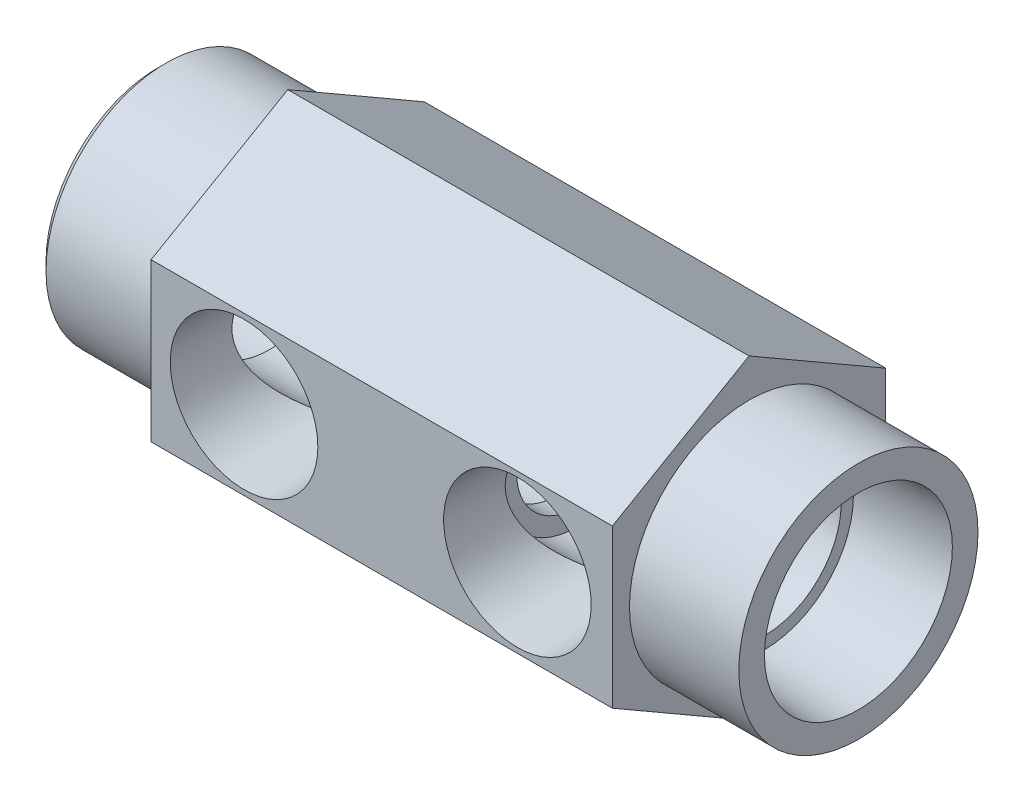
ISO-10303-21;
HEADER;
FILE_DESCRIPTION(('STEP AP214'),'2;1');
FILE_NAME('part.step','',(''),(''),'','','');
FILE_SCHEMA(('AUTOMOTIVE_DESIGN { 1 0 10303 214 1 1 1 1 }'));
ENDSEC;
DATA;
#1=APPLICATION_CONTEXT('core data for automotive mechanical design processes');
#2=APPLICATION_PROTOCOL_DEFINITION('international standard','automotive_design',2000,#1);
#3=PRODUCT_CONTEXT('',#1,'mechanical');
#4=PRODUCT('Part','Part','',(#3));
#5=PRODUCT_RELATED_PRODUCT_CATEGORY('part','',(#4));
#6=PRODUCT_DEFINITION_FORMATION('','',#4);
#7=PRODUCT_DEFINITION_CONTEXT('part definition',#1,'design');
#8=PRODUCT_DEFINITION('design','',#6,#7);
#9=PRODUCT_DEFINITION_SHAPE('','',#8);
#10=(LENGTH_UNIT() NAMED_UNIT(*) SI_UNIT(.MILLI.,.METRE.));
#11=(NAMED_UNIT(*) PLANE_ANGLE_UNIT() SI_UNIT($,.RADIAN.));
#12=(NAMED_UNIT(*) SI_UNIT($,.STERADIAN.) SOLID_ANGLE_UNIT());
#13=UNCERTAINTY_MEASURE_WITH_UNIT(LENGTH_MEASURE(1.E-05),#10,'distance_accuracy_value','');
#14=(GEOMETRIC_REPRESENTATION_CONTEXT(3) GLOBAL_UNCERTAINTY_ASSIGNED_CONTEXT((#13)) GLOBAL_UNIT_ASSIGNED_CONTEXT((#10,
#11,#12)) REPRESENTATION_CONTEXT('',''));
#15=CARTESIAN_POINT('',(0.,0.,0.));
#16=DIRECTION('',(0.,0.,1.));
#17=DIRECTION('',(1.,0.,0.));
#18=AXIS2_PLACEMENT_3D('',#15,#16,#17);
#19=CARTESIAN_POINT('',(14.9225,7.1374,0.));
#20=DIRECTION('',(1.,0.,0.));
#21=DIRECTION('',(0.,0.,-1.));
#22=AXIS2_PLACEMENT_3D('',#19,#20,#21);
#23=PLANE('',#22);
#24=CARTESIAN_POINT('',(14.9225,0.,0.));
#25=DIRECTION('',(-1.,0.,0.));
#26=DIRECTION('',(0.,0.,1.));
#27=AXIS2_PLACEMENT_3D('',#24,#25,#26);
#28=CIRCLE('',#27,6.858);
#29=CARTESIAN_POINT('',(14.9225,2.23469039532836,6.48369669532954));
#30=VERTEX_POINT('',#29);
#31=CARTESIAN_POINT('',(14.9225,2.23469039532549,-6.48369669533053));
#32=VERTEX_POINT('',#31);
#33=EDGE_CURVE('E113',#30,#32,#28,.T.);
#34=ORIENTED_EDGE('',*,*,#33,.F.);
#35=CARTESIAN_POINT('',(14.9225,3.09576989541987,17.6902780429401));
#36=CARTESIAN_POINT('',(14.9225,3.02328790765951,16.6220883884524));
#37=CARTESIAN_POINT('',(14.9225,2.94893325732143,15.5540183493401));
#38=CARTESIAN_POINT('',(14.9225,2.79508998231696,13.4181899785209));
#39=CARTESIAN_POINT('',(14.9225,2.7156010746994,12.3504316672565));
#40=CARTESIAN_POINT('',(14.9225,2.54990543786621,10.212799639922));
#41=CARTESIAN_POINT('',(14.9225,2.4636827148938,9.14292715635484));
#42=CARTESIAN_POINT('',(14.9225,2.28237035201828,7.00394443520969));
#43=CARTESIAN_POINT('',(14.9225,2.1872809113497,5.93483418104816));
#44=CARTESIAN_POINT('',(14.9225,2.03489474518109,4.33246827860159));
#45=CARTESIAN_POINT('',(14.9225,1.98249388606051,3.79874778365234));
#46=CARTESIAN_POINT('',(14.9225,1.87354450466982,2.73173191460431));
#47=CARTESIAN_POINT('',(14.9225,1.81699602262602,2.19843653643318));
#48=CARTESIAN_POINT('',(14.9225,1.69851762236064,1.13291672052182));
#49=CARTESIAN_POINT('',(14.9225,1.63659248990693,0.600691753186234));
#50=CARTESIAN_POINT('',(14.9225,1.50527587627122,-0.462864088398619));
#51=CARTESIAN_POINT('',(14.9225,1.4358843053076,-0.994194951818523));
#52=CARTESIAN_POINT('',(14.9225,1.32320822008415,-1.7901747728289));
#53=CARTESIAN_POINT('',(14.9225,1.28420256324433,-2.05542676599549));
#54=CARTESIAN_POINT('',(14.9225,1.20243394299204,-2.58532344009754));
#55=CARTESIAN_POINT('',(14.9225,1.15967141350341,-2.84996818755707));
#56=CARTESIAN_POINT('',(14.9225,1.06900416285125,-3.37859231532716));
#57=CARTESIAN_POINT('',(14.9225,1.02109570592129,-3.64257106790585));
#58=CARTESIAN_POINT('',(14.9225,0.943509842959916,-4.03747002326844));
#59=CARTESIAN_POINT('',(14.9225,0.916688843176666,-4.16894767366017));
#60=CARTESIAN_POINT('',(14.9225,0.860524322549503,-4.43137830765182));
#61=CARTESIAN_POINT('',(14.9225,0.831180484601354,-4.56233122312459));
#62=CARTESIAN_POINT('',(14.9225,0.800270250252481,-4.69292884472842));
#63=B_SPLINE_CURVE_WITH_KNOTS('',3,(#35,#36,#37,#38,#39,#40,#41,#42,#43,#44,#45,#46,#47,#48,#49,
#50,#51,#52,#53,#54,#55,#56,#57,#58,#59,#60,#61,#62),.UNSPECIFIED.,.F.,.F.,(4,2,2,2,2,2,2,2,2,2,
2,2,2,4),(0.,3.21194774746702,6.42407265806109,9.64407348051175,12.8640019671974,
14.4728505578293,16.0816835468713,17.6890989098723,19.2965336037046,20.1008271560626,
20.9050279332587,21.7098165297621,22.1123514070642,22.5149369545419),.UNSPECIFIED.);
#64=CARTESIAN_POINT('',(14.9225,2.26016326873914,6.77009163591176));
#65=VERTEX_POINT('',#64);
#66=EDGE_CURVE('E119',#65,#30,#63,.T.);
#67=ORIENTED_EDGE('',*,*,#66,.F.);
#68=CARTESIAN_POINT('',(14.9225,0.,0.));
#69=DIRECTION('',(-1.,0.,0.));
#70=DIRECTION('',(0.,0.,1.));
#71=AXIS2_PLACEMENT_3D('',#68,#69,#70);
#72=CIRCLE('',#71,7.1374);
#73=CARTESIAN_POINT('',(14.9225,2.2601632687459,-6.7700916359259));
#74=VERTEX_POINT('',#73);
#75=EDGE_CURVE('E129',#65,#74,#72,.T.);
#76=ORIENTED_EDGE('',*,*,#75,.T.);
#77=CARTESIAN_POINT('',(14.9225,3.09576989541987,-17.6902780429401));
#78=CARTESIAN_POINT('',(14.9225,3.02328790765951,-16.6220883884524));
#79=CARTESIAN_POINT('',(14.9225,2.94893325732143,-15.5540183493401));
#80=CARTESIAN_POINT('',(14.9225,2.79508998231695,-13.4181899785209));
#81=CARTESIAN_POINT('',(14.9225,2.7156010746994,-12.3504316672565));
#82=CARTESIAN_POINT('',(14.9225,2.54990543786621,-10.212799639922));
#83=CARTESIAN_POINT('',(14.9225,2.4636827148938,-9.14292715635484));
#84=CARTESIAN_POINT('',(14.9225,2.28237035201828,-7.00394443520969));
#85=CARTESIAN_POINT('',(14.9225,2.18728091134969,-5.93483418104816));
#86=CARTESIAN_POINT('',(14.9225,2.03489474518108,-4.3324682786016));
#87=CARTESIAN_POINT('',(14.9225,1.98249388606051,-3.79874778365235));
#88=CARTESIAN_POINT('',(14.9225,1.87354450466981,-2.73173191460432));
#89=CARTESIAN_POINT('',(14.9225,1.81699602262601,-2.19843653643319));
#90=CARTESIAN_POINT('',(14.9225,1.69851762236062,-1.13291672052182));
#91=CARTESIAN_POINT('',(14.9225,1.63659248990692,-0.600691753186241));
#92=CARTESIAN_POINT('',(14.9225,1.5052758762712,0.462864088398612));
#93=CARTESIAN_POINT('',(14.9225,1.43588430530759,0.994194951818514));
#94=CARTESIAN_POINT('',(14.9225,1.32320822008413,1.79017477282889));
#95=CARTESIAN_POINT('',(14.9225,1.28420256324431,2.05542676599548));
#96=CARTESIAN_POINT('',(14.9225,1.20243394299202,2.58532344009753));
#97=CARTESIAN_POINT('',(14.9225,1.15967141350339,2.84996818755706));
#98=CARTESIAN_POINT('',(14.9225,1.06900416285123,3.37859231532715));
#99=CARTESIAN_POINT('',(14.9225,1.02109570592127,3.64257106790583));
#100=CARTESIAN_POINT('',(14.9225,0.943509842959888,4.03747002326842));
#101=CARTESIAN_POINT('',(14.9225,0.916688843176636,4.16894767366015));
#102=CARTESIAN_POINT('',(14.9225,0.860524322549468,4.43137830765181));
#103=CARTESIAN_POINT('',(14.9225,0.831180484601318,4.56233122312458));
#104=CARTESIAN_POINT('',(14.9225,0.800270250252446,4.6929288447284));
#105=B_SPLINE_CURVE_WITH_KNOTS('',3,(#77,#78,#79,#80,#81,#82,#83,#84,#85,#86,#87,#88,#89,#90,
#91,#92,#93,#94,#95,#96,#97,#98,#99,#100,#101,#102,#103,#104),.UNSPECIFIED.,.F.,.F.,(4,2,2,2,2,
2,2,2,2,2,2,2,2,4),(0.,3.21194774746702,6.42407265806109,9.64407348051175,12.8640019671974,
14.4728505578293,16.0816835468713,17.6890989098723,19.2965336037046,20.1008271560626,
20.9050279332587,21.7098165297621,22.1123514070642,22.5149369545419),.UNSPECIFIED.);
#106=EDGE_CURVE('E58',#32,#74,#105,.F.);
#107=ORIENTED_EDGE('',*,*,#106,.F.);
#108=EDGE_LOOP('',(#34,#67,#76,#107));
#109=FACE_BOUND('',#108,.T.);
#110=ADVANCED_FACE('F36',(#109),#23,.F.);
#111=CARTESIAN_POINT('',(14.9225,-2.23469039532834,-6.48369669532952));
#112=VERTEX_POINT('',#111);
#113=CARTESIAN_POINT('',(14.9225,-2.23469039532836,6.48369669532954));
#114=VERTEX_POINT('',#113);
#115=EDGE_CURVE('E114',#112,#114,#28,.T.);
#116=ORIENTED_EDGE('',*,*,#115,.F.);
#117=CARTESIAN_POINT('',(14.9225,-3.09576989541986,-17.6902780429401));
#118=CARTESIAN_POINT('',(14.9225,-3.02328790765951,-16.6220883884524));
#119=CARTESIAN_POINT('',(14.9225,-2.94893325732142,-15.5540183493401));
#120=CARTESIAN_POINT('',(14.9225,-2.79508998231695,-13.4181899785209));
#121=CARTESIAN_POINT('',(14.9225,-2.71560107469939,-12.3504316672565));
#122=CARTESIAN_POINT('',(14.9225,-2.5499054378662,-10.212799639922));
#123=CARTESIAN_POINT('',(14.9225,-2.46368271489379,-9.14292715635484));
#124=CARTESIAN_POINT('',(14.9225,-2.28237035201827,-7.00394443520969));
#125=CARTESIAN_POINT('',(14.9225,-2.18728091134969,-5.93483418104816));
#126=CARTESIAN_POINT('',(14.9225,-2.03489474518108,-4.3324682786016));
#127=CARTESIAN_POINT('',(14.9225,-1.9824938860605,-3.79874778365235));
#128=CARTESIAN_POINT('',(14.9225,-1.8735445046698,-2.73173191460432));
#129=CARTESIAN_POINT('',(14.9225,-1.816996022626,-2.19843653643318));
#130=CARTESIAN_POINT('',(14.9225,-1.69851762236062,-1.13291672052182));
#131=CARTESIAN_POINT('',(14.9225,-1.63659248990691,-0.600691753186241));
#132=CARTESIAN_POINT('',(14.9225,-1.5052758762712,0.462864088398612));
#133=CARTESIAN_POINT('',(14.9225,-1.43588430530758,0.994194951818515));
#134=CARTESIAN_POINT('',(14.9225,-1.32320822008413,1.79017477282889));
#135=CARTESIAN_POINT('',(14.9225,-1.28420256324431,2.05542676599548));
#136=CARTESIAN_POINT('',(14.9225,-1.20243394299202,2.58532344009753));
#137=CARTESIAN_POINT('',(14.9225,-1.15967141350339,2.84996818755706));
#138=CARTESIAN_POINT('',(14.9225,-1.06900416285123,3.37859231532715));
#139=CARTESIAN_POINT('',(14.9225,-1.02109570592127,3.64257106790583));
#140=CARTESIAN_POINT('',(14.9225,-0.943509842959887,4.03747002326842));
#141=CARTESIAN_POINT('',(14.9225,-0.916688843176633,4.16894767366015));
#142=CARTESIAN_POINT('',(14.9225,-0.860524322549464,4.43137830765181));
#143=CARTESIAN_POINT('',(14.9225,-0.831180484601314,4.56233122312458));
#144=CARTESIAN_POINT('',(14.9225,-0.800270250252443,4.6929288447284));
#145=B_SPLINE_CURVE_WITH_KNOTS('',3,(#117,#118,#119,#120,#121,#122,#123,#124,#125,#126,#127,
#128,#129,#130,#131,#132,#133,#134,#135,#136,#137,#138,#139,#140,#141,#142,#143,#144),
.UNSPECIFIED.,.F.,.F.,(4,2,2,2,2,2,2,2,2,2,2,2,2,4),(0.,3.21194774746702,6.42407265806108,
9.64407348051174,12.8640019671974,14.4728505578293,16.0816835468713,17.6890989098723,
19.2965336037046,20.1008271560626,20.9050279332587,21.7098165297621,22.1123514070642,
22.5149369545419),.UNSPECIFIED.);
#146=CARTESIAN_POINT('',(14.9225,-2.26016326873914,-6.77009163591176));
#147=VERTEX_POINT('',#146);
#148=EDGE_CURVE('E171',#147,#112,#145,.T.);
#149=ORIENTED_EDGE('',*,*,#148,.F.);
#150=CARTESIAN_POINT('',(14.9225,-2.26016326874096,6.77009163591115));
#151=VERTEX_POINT('',#150);
#152=EDGE_CURVE('E133',#147,#151,#72,.T.);
#153=ORIENTED_EDGE('',*,*,#152,.T.);
#154=CARTESIAN_POINT('',(14.9225,-3.09576989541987,17.6902780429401));
#155=CARTESIAN_POINT('',(14.9225,-3.02328790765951,16.6220883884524));
#156=CARTESIAN_POINT('',(14.9225,-2.94893325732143,15.5540183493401));
#157=CARTESIAN_POINT('',(14.9225,-2.79508998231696,13.4181899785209));
#158=CARTESIAN_POINT('',(14.9225,-2.7156010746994,12.3504316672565));
#159=CARTESIAN_POINT('',(14.9225,-2.54990543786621,10.212799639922));
#160=CARTESIAN_POINT('',(14.9225,-2.4636827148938,9.14292715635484));
#161=CARTESIAN_POINT('',(14.9225,-2.28237035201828,7.00394443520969));
#162=CARTESIAN_POINT('',(14.9225,-2.1872809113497,5.93483418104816));
#163=CARTESIAN_POINT('',(14.9225,-2.03489474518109,4.33246827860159));
#164=CARTESIAN_POINT('',(14.9225,-1.98249388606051,3.79874778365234));
#165=CARTESIAN_POINT('',(14.9225,-1.87354450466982,2.73173191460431));
#166=CARTESIAN_POINT('',(14.9225,-1.81699602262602,2.19843653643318));
#167=CARTESIAN_POINT('',(14.9225,-1.69851762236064,1.13291672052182));
#168=CARTESIAN_POINT('',(14.9225,-1.63659248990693,0.600691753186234));
#169=CARTESIAN_POINT('',(14.9225,-1.50527587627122,-0.462864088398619));
#170=CARTESIAN_POINT('',(14.9225,-1.4358843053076,-0.994194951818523));
#171=CARTESIAN_POINT('',(14.9225,-1.32320822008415,-1.7901747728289));
#172=CARTESIAN_POINT('',(14.9225,-1.28420256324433,-2.05542676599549));
#173=CARTESIAN_POINT('',(14.9225,-1.20243394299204,-2.58532344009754));
#174=CARTESIAN_POINT('',(14.9225,-1.15967141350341,-2.84996818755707));
#175=CARTESIAN_POINT('',(14.9225,-1.06900416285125,-3.37859231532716));
#176=CARTESIAN_POINT('',(14.9225,-1.02109570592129,-3.64257106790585));
#177=CARTESIAN_POINT('',(14.9225,-0.943509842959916,-4.03747002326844));
#178=CARTESIAN_POINT('',(14.9225,-0.916688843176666,-4.16894767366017));
#179=CARTESIAN_POINT('',(14.9225,-0.860524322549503,-4.43137830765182));
#180=CARTESIAN_POINT('',(14.9225,-0.831180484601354,-4.56233122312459));
#181=CARTESIAN_POINT('',(14.9225,-0.800270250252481,-4.69292884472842));
#182=B_SPLINE_CURVE_WITH_KNOTS('',3,(#154,#155,#156,#157,#158,#159,#160,#161,#162,#163,#164,
#165,#166,#167,#168,#169,#170,#171,#172,#173,#174,#175,#176,#177,#178,#179,#180,#181),
.UNSPECIFIED.,.F.,.F.,(4,2,2,2,2,2,2,2,2,2,2,2,2,4),(0.,3.21194774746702,6.42407265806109,
9.64407348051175,12.8640019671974,14.4728505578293,16.0816835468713,17.6890989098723,
19.2965336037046,20.1008271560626,20.9050279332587,21.7098165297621,22.1123514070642,
22.5149369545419),.UNSPECIFIED.);
#183=EDGE_CURVE('E128',#114,#151,#182,.F.);
#184=ORIENTED_EDGE('',*,*,#183,.F.);
#185=EDGE_LOOP('',(#116,#149,#153,#184));
#186=FACE_BOUND('',#185,.T.);
#187=ADVANCED_FACE('F154',(#186),#23,.F.);
#188=CARTESIAN_POINT('',(53.0225,0.,0.));
#189=DIRECTION('',(-1.,0.,0.));
#190=DIRECTION('',(0.,0.,1.));
#191=AXIS2_PLACEMENT_3D('',#188,#189,#190);
#192=PLANE('',#191);
#193=CARTESIAN_POINT('',(53.0225,0.,0.));
#194=DIRECTION('',(-1.,0.,0.));
#195=DIRECTION('',(0.,0.,1.));
#196=AXIS2_PLACEMENT_3D('',#193,#194,#195);
#197=CIRCLE('',#196,11.1125);
#198=CARTESIAN_POINT('',(53.0225,0.,11.1125));
#199=VERTEX_POINT('',#198);
#200=EDGE_CURVE('E273',#199,#199,#197,.T.);
#201=ORIENTED_EDGE('',*,*,#200,.F.);
#202=EDGE_LOOP('',(#201));
#203=FACE_BOUND('',#202,.T.);
#204=CARTESIAN_POINT('',(53.0225,0.,0.));
#205=DIRECTION('',(-1.,0.,0.));
#206=DIRECTION('',(0.,0.,1.));
#207=AXIS2_PLACEMENT_3D('',#204,#205,#206);
#208=CIRCLE('',#207,8.73125);
#209=CARTESIAN_POINT('',(53.0225,0.,8.73125));
#210=VERTEX_POINT('',#209);
#211=EDGE_CURVE('E261',#210,#210,#208,.T.);
#212=ORIENTED_EDGE('',*,*,#211,.T.);
#213=EDGE_LOOP('',(#212));
#214=FACE_BOUND('',#213,.T.);
#215=ADVANCED_FACE('F356',(#203,#214),#192,.F.);
#216=CARTESIAN_POINT('',(42.8625,-7.33234841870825,-12.7));
#217=DIRECTION('',(0.,0.,1.));
#218=DIRECTION('',(0.,-1.,0.));
#219=AXIS2_PLACEMENT_3D('',#216,#217,#218);
#220=PLANE('',#219);
#221=CARTESIAN_POINT('',(8.636,0.,-12.7));
#222=DIRECTION('',(0.,0.,-1.));
#223=DIRECTION('',(0.,1.,0.));
#224=AXIS2_PLACEMENT_3D('',#221,#222,#223);
#225=CIRCLE('',#224,6.858);
#226=CARTESIAN_POINT('',(8.636,6.858,-12.7));
#227=VERTEX_POINT('',#226);
#228=EDGE_CURVE('E131',#227,#227,#225,.T.);
#229=ORIENTED_EDGE('',*,*,#228,.F.);
#230=EDGE_LOOP('',(#229));
#231=FACE_BOUND('',#230,.T.);
#232=DIRECTION('',(0.,1.,0.));
#233=VECTOR('',#232,1.);
#234=CARTESIAN_POINT('',(0.,-7.33234841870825,-12.7));
#235=LINE('',#234,#233);
#236=CARTESIAN_POINT('',(0.,-7.33234841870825,-12.7));
#237=VERTEX_POINT('',#236);
#238=CARTESIAN_POINT('',(0.,7.33234841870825,-12.7));
#239=VERTEX_POINT('',#238);
#240=EDGE_CURVE('E276',#237,#239,#235,.T.);
#241=ORIENTED_EDGE('',*,*,#240,.T.);
#242=DIRECTION('',(-1.,0.,0.));
#243=VECTOR('',#242,1.);
#244=CARTESIAN_POINT('',(42.8625,7.33234841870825,-12.7));
#245=LINE('',#244,#243);
#246=CARTESIAN_POINT('',(42.8625,7.33234841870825,-12.7));
#247=VERTEX_POINT('',#246);
#248=EDGE_CURVE('E281',#247,#239,#245,.T.);
#249=ORIENTED_EDGE('',*,*,#248,.F.);
#250=DIRECTION('',(0.,1.,0.));
#251=VECTOR('',#250,1.);
#252=CARTESIAN_POINT('',(42.8625,-7.33234841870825,-12.7));
#253=LINE('',#252,#251);
#254=CARTESIAN_POINT('',(42.8625,-7.33234841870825,-12.7));
#255=VERTEX_POINT('',#254);
#256=EDGE_CURVE('E282',#255,#247,#253,.T.);
#257=ORIENTED_EDGE('',*,*,#256,.F.);
#258=DIRECTION('',(-1.,0.,0.));
#259=VECTOR('',#258,1.);
#260=CARTESIAN_POINT('',(42.8625,-7.33234841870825,-12.7));
#261=LINE('',#260,#259);
#262=EDGE_CURVE('E296',#255,#237,#261,.T.);
#263=ORIENTED_EDGE('',*,*,#262,.T.);
#264=EDGE_LOOP('',(#241,#249,#257,#263));
#265=FACE_BOUND('',#264,.T.);
#266=ADVANCED_FACE('F352',(#231,#265),#220,.F.);
#267=CARTESIAN_POINT('',(42.8625,7.33234841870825,-12.7));
#268=DIRECTION('',(0.,-0.866025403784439,0.5));
#269=DIRECTION('',(0.,-0.5,-0.866025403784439));
#270=AXIS2_PLACEMENT_3D('',#267,#268,#269);
#271=PLANE('',#270);
#272=DIRECTION('',(0.,0.5,0.866025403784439));
#273=VECTOR('',#272,1.);
#274=CARTESIAN_POINT('',(0.,7.33234841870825,-12.7));
#275=LINE('',#274,#273);
#276=CARTESIAN_POINT('',(0.,14.6646968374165,0.));
#277=VERTEX_POINT('',#276);
#278=EDGE_CURVE('E299',#239,#277,#275,.T.);
#279=ORIENTED_EDGE('',*,*,#278,.T.);
#280=DIRECTION('',(-1.,0.,0.));
#281=VECTOR('',#280,1.);
#282=CARTESIAN_POINT('',(42.8625,14.6646968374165,0.));
#283=LINE('',#282,#281);
#284=CARTESIAN_POINT('',(42.8625,14.6646968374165,0.));
#285=VERTEX_POINT('',#284);
#286=EDGE_CURVE('E319',#285,#277,#283,.T.);
#287=ORIENTED_EDGE('',*,*,#286,.F.);
#288=DIRECTION('',(0.,0.5,0.866025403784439));
#289=VECTOR('',#288,1.);
#290=CARTESIAN_POINT('',(42.8625,7.33234841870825,-12.7));
#291=LINE('',#290,#289);
#292=EDGE_CURVE('E285',#247,#285,#291,.T.);
#293=ORIENTED_EDGE('',*,*,#292,.F.);
#294=ORIENTED_EDGE('',*,*,#248,.T.);
#295=EDGE_LOOP('',(#279,#287,#293,#294));
#296=FACE_BOUND('',#295,.T.);
#297=ADVANCED_FACE('F355',(#296),#271,.F.);
#298=CARTESIAN_POINT('',(42.8625,14.6646968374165,0.));
#299=DIRECTION('',(0.,-0.866025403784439,-0.5));
#300=DIRECTION('',(0.,0.5,-0.866025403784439));
#301=AXIS2_PLACEMENT_3D('',#298,#299,#300);
#302=PLANE('',#301);
#303=DIRECTION('',(0.,-0.5,0.866025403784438));
#304=VECTOR('',#303,1.);
#305=CARTESIAN_POINT('',(0.,14.6646968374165,0.));
#306=LINE('',#305,#304);
#307=CARTESIAN_POINT('',(0.,7.33234841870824,12.7));
#308=VERTEX_POINT('',#307);
#309=EDGE_CURVE('E301',#277,#308,#306,.T.);
#310=ORIENTED_EDGE('',*,*,#309,.T.);
#311=DIRECTION('',(-1.,0.,0.));
#312=VECTOR('',#311,1.);
#313=CARTESIAN_POINT('',(42.8625,7.33234841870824,12.7));
#314=LINE('',#313,#312);
#315=CARTESIAN_POINT('',(42.8625,7.33234841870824,12.7));
#316=VERTEX_POINT('',#315);
#317=EDGE_CURVE('E316',#316,#308,#314,.T.);
#318=ORIENTED_EDGE('',*,*,#317,.F.);
#319=DIRECTION('',(0.,-0.5,0.866025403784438));
#320=VECTOR('',#319,1.);
#321=CARTESIAN_POINT('',(42.8625,14.6646968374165,0.));
#322=LINE('',#321,#320);
#323=EDGE_CURVE('E288',#285,#316,#322,.T.);
#324=ORIENTED_EDGE('',*,*,#323,.F.);
#325=ORIENTED_EDGE('',*,*,#286,.T.);
#326=EDGE_LOOP('',(#310,#318,#324,#325));
#327=FACE_BOUND('',#326,.T.);
#328=ADVANCED_FACE('F386',(#327),#302,.F.);
#329=CARTESIAN_POINT('',(42.8625,7.33234841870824,12.7));
#330=DIRECTION('',(0.,0.,-1.));
#331=DIRECTION('',(-1.,0.,0.));
#332=AXIS2_PLACEMENT_3D('',#329,#330,#331);
#333=PLANE('',#332);
#334=CARTESIAN_POINT('',(8.636,0.,12.7));
#335=DIRECTION('',(0.,0.,1.));
#336=DIRECTION('',(1.,0.,0.));
#337=AXIS2_PLACEMENT_3D('',#334,#335,#336);
#338=CIRCLE('',#337,6.858);
#339=CARTESIAN_POINT('',(15.494,0.,12.7));
#340=VERTEX_POINT('',#339);
#341=EDGE_CURVE('E345',#340,#340,#338,.T.);
#342=ORIENTED_EDGE('',*,*,#341,.F.);
#343=EDGE_LOOP('',(#342));
#344=FACE_BOUND('',#343,.T.);
#345=CARTESIAN_POINT('',(34.036,0.,12.7));
#346=DIRECTION('',(0.,0.,1.));
#347=DIRECTION('',(1.,0.,0.));
#348=AXIS2_PLACEMENT_3D('',#345,#346,#347);
#349=CIRCLE('',#348,6.858);
#350=CARTESIAN_POINT('',(40.894,0.,12.7));
#351=VERTEX_POINT('',#350);
#352=EDGE_CURVE('E330',#351,#351,#349,.T.);
#353=ORIENTED_EDGE('',*,*,#352,.F.);
#354=EDGE_LOOP('',(#353));
#355=FACE_BOUND('',#354,.T.);
#356=DIRECTION('',(0.,-1.,0.));
#357=VECTOR('',#356,1.);
#358=CARTESIAN_POINT('',(0.,7.33234841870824,12.7));
#359=LINE('',#358,#357);
#360=CARTESIAN_POINT('',(0.,-7.33234841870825,12.7));
#361=VERTEX_POINT('',#360);
#362=EDGE_CURVE('E303',#308,#361,#359,.T.);
#363=ORIENTED_EDGE('',*,*,#362,.T.);
#364=DIRECTION('',(-1.,0.,0.));
#365=VECTOR('',#364,1.);
#366=CARTESIAN_POINT('',(42.8625,-7.33234841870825,12.7));
#367=LINE('',#366,#365);
#368=CARTESIAN_POINT('',(42.8625,-7.33234841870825,12.7));
#369=VERTEX_POINT('',#368);
#370=EDGE_CURVE('E313',#369,#361,#367,.T.);
#371=ORIENTED_EDGE('',*,*,#370,.F.);
#372=DIRECTION('',(0.,-1.,0.));
#373=VECTOR('',#372,1.);
#374=CARTESIAN_POINT('',(42.8625,7.33234841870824,12.7));
#375=LINE('',#374,#373);
#376=EDGE_CURVE('E290',#316,#369,#375,.T.);
#377=ORIENTED_EDGE('',*,*,#376,.F.);
#378=ORIENTED_EDGE('',*,*,#317,.T.);
#379=EDGE_LOOP('',(#363,#371,#377,#378));
#380=FACE_BOUND('',#379,.T.);
#381=ADVANCED_FACE('F382',(#344,#355,#380),#333,.F.);
#382=CARTESIAN_POINT('',(42.8625,-7.33234841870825,12.7));
#383=DIRECTION('',(0.,0.866025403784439,-0.5));
#384=DIRECTION('',(0.,0.5,0.866025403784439));
#385=AXIS2_PLACEMENT_3D('',#382,#383,#384);
#386=PLANE('',#385);
#387=DIRECTION('',(0.,-0.5,-0.866025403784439));
#388=VECTOR('',#387,1.);
#389=CARTESIAN_POINT('',(0.,-7.33234841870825,12.7));
#390=LINE('',#389,#388);
#391=CARTESIAN_POINT('',(0.,-14.6646968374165,0.));
#392=VERTEX_POINT('',#391);
#393=EDGE_CURVE('E305',#361,#392,#390,.T.);
#394=ORIENTED_EDGE('',*,*,#393,.T.);
#395=DIRECTION('',(-1.,0.,0.));
#396=VECTOR('',#395,1.);
#397=CARTESIAN_POINT('',(42.8625,-14.6646968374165,0.));
#398=LINE('',#397,#396);
#399=CARTESIAN_POINT('',(42.8625,-14.6646968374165,0.));
#400=VERTEX_POINT('',#399);
#401=EDGE_CURVE('E310',#400,#392,#398,.T.);
#402=ORIENTED_EDGE('',*,*,#401,.F.);
#403=DIRECTION('',(0.,-0.5,-0.866025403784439));
#404=VECTOR('',#403,1.);
#405=CARTESIAN_POINT('',(42.8625,-7.33234841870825,12.7));
#406=LINE('',#405,#404);
#407=EDGE_CURVE('E292',#369,#400,#406,.T.);
#408=ORIENTED_EDGE('',*,*,#407,.F.);
#409=ORIENTED_EDGE('',*,*,#370,.T.);
#410=EDGE_LOOP('',(#394,#402,#408,#409));
#411=FACE_BOUND('',#410,.T.);
#412=ADVANCED_FACE('F379',(#411),#386,.F.);
#413=CARTESIAN_POINT('',(42.8625,-14.6646968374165,0.));
#414=DIRECTION('',(0.,0.866025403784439,0.5));
#415=DIRECTION('',(0.,-0.5,0.866025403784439));
#416=AXIS2_PLACEMENT_3D('',#413,#414,#415);
#417=PLANE('',#416);
#418=DIRECTION('',(0.,0.5,-0.866025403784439));
#419=VECTOR('',#418,1.);
#420=CARTESIAN_POINT('',(0.,-14.6646968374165,0.));
#421=LINE('',#420,#419);
#422=EDGE_CURVE('E286',#392,#237,#421,.T.);
#423=ORIENTED_EDGE('',*,*,#422,.T.);
#424=ORIENTED_EDGE('',*,*,#262,.F.);
#425=DIRECTION('',(0.,0.5,-0.866025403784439));
#426=VECTOR('',#425,1.);
#427=CARTESIAN_POINT('',(42.8625,-14.6646968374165,0.));
#428=LINE('',#427,#426);
#429=EDGE_CURVE('E294',#400,#255,#428,.T.);
#430=ORIENTED_EDGE('',*,*,#429,.F.);
#431=ORIENTED_EDGE('',*,*,#401,.T.);
#432=EDGE_LOOP('',(#423,#424,#430,#431));
#433=FACE_BOUND('',#432,.T.);
#434=ADVANCED_FACE('F377',(#433),#417,.F.);
#435=CARTESIAN_POINT('',(42.8625,7.33234841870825,-12.7));
#436=DIRECTION('',(1.,0.,0.));
#437=DIRECTION('',(0.,0.,-1.));
#438=AXIS2_PLACEMENT_3D('',#435,#436,#437);
#439=PLANE('',#438);
#440=CARTESIAN_POINT('',(42.8625,0.,0.));
#441=DIRECTION('',(1.,0.,0.));
#442=DIRECTION('',(0.,0.,-1.));
#443=AXIS2_PLACEMENT_3D('',#440,#441,#442);
#444=CIRCLE('',#443,11.1125);
#445=CARTESIAN_POINT('',(42.8625,0.,11.1125));
#446=VERTEX_POINT('',#445);
#447=EDGE_CURVE('E277',#446,#446,#444,.T.);
#448=ORIENTED_EDGE('',*,*,#447,.F.);
#449=EDGE_LOOP('',(#448));
#450=FACE_BOUND('',#449,.T.);
#451=ORIENTED_EDGE('',*,*,#256,.T.);
#452=ORIENTED_EDGE('',*,*,#292,.T.);
#453=ORIENTED_EDGE('',*,*,#323,.T.);
#454=ORIENTED_EDGE('',*,*,#376,.T.);
#455=ORIENTED_EDGE('',*,*,#407,.T.);
#456=ORIENTED_EDGE('',*,*,#429,.T.);
#457=EDGE_LOOP('',(#451,#452,#453,#454,#455,#456));
#458=FACE_BOUND('',#457,.T.);
#459=ADVANCED_FACE('F372',(#450,#458),#439,.T.);
#460=CARTESIAN_POINT('',(0.,7.33234841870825,-12.7));
#461=DIRECTION('',(1.,0.,0.));
#462=DIRECTION('',(0.,0.,-1.));
#463=AXIS2_PLACEMENT_3D('',#460,#461,#462);
#464=PLANE('',#463);
#465=CARTESIAN_POINT('',(0.,0.,0.));
#466=DIRECTION('',(1.,0.,0.));
#467=DIRECTION('',(0.,0.,-1.));
#468=AXIS2_PLACEMENT_3D('',#465,#466,#467);
#469=CIRCLE('',#468,11.938);
#470=CARTESIAN_POINT('',(0.,0.,-11.938));
#471=VERTEX_POINT('',#470);
#472=EDGE_CURVE('E409',#471,#471,#469,.T.);
#473=ORIENTED_EDGE('',*,*,#472,.T.);
#474=EDGE_LOOP('',(#473));
#475=FACE_BOUND('',#474,.T.);
#476=ORIENTED_EDGE('',*,*,#240,.F.);
#477=ORIENTED_EDGE('',*,*,#422,.F.);
#478=ORIENTED_EDGE('',*,*,#393,.F.);
#479=ORIENTED_EDGE('',*,*,#362,.F.);
#480=ORIENTED_EDGE('',*,*,#309,.F.);
#481=ORIENTED_EDGE('',*,*,#278,.F.);
#482=EDGE_LOOP('',(#476,#477,#478,#479,#480,#481));
#483=FACE_BOUND('',#482,.T.);
#484=ADVANCED_FACE('F364',(#475,#483),#464,.F.);
#485=CARTESIAN_POINT('',(53.0225,0.,0.));
#486=DIRECTION('',(-1.,0.,0.));
#487=DIRECTION('',(0.,0.,1.));
#488=AXIS2_PLACEMENT_3D('',#485,#486,#487);
#489=CYLINDRICAL_SURFACE('',#488,11.1125);
#490=CARTESIAN_POINT('',(42.8625,0.,11.1125));
#491=CARTESIAN_POINT('',(42.9683333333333,0.,11.1125));
#492=CARTESIAN_POINT('',(43.0741666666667,0.,11.1125));
#493=CARTESIAN_POINT('',(43.2858333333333,0.,11.1125));
#494=CARTESIAN_POINT('',(43.3916666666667,0.,11.1125));
#495=CARTESIAN_POINT('',(43.6033333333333,0.,11.1125));
#496=CARTESIAN_POINT('',(43.7091666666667,0.,11.1125));
#497=CARTESIAN_POINT('',(43.9208333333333,0.,11.1125));
#498=CARTESIAN_POINT('',(44.0266666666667,0.,11.1125));
#499=CARTESIAN_POINT('',(44.2383333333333,0.,11.1125));
#500=CARTESIAN_POINT('',(44.3441666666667,0.,11.1125));
#501=CARTESIAN_POINT('',(44.5558333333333,0.,11.1125));
#502=CARTESIAN_POINT('',(44.6616666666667,0.,11.1125));
#503=CARTESIAN_POINT('',(44.8733333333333,0.,11.1125));
#504=CARTESIAN_POINT('',(44.9791666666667,0.,11.1125));
#505=CARTESIAN_POINT('',(45.1908333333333,0.,11.1125));
#506=CARTESIAN_POINT('',(45.2966666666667,0.,11.1125));
#507=CARTESIAN_POINT('',(45.5083333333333,0.,11.1125));
#508=CARTESIAN_POINT('',(45.6141666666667,0.,11.1125));
#509=CARTESIAN_POINT('',(45.8258333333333,0.,11.1125));
#510=CARTESIAN_POINT('',(45.9316666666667,0.,11.1125));
#511=CARTESIAN_POINT('',(46.1433333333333,0.,11.1125));
#512=CARTESIAN_POINT('',(46.2491666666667,0.,11.1125));
#513=CARTESIAN_POINT('',(46.4608333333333,0.,11.1125));
#514=CARTESIAN_POINT('',(46.5666666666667,0.,11.1125));
#515=CARTESIAN_POINT('',(46.7783333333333,0.,11.1125));
#516=CARTESIAN_POINT('',(46.8841666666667,0.,11.1125));
#517=CARTESIAN_POINT('',(47.0958333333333,0.,11.1125));
#518=CARTESIAN_POINT('',(47.2016666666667,0.,11.1125));
#519=CARTESIAN_POINT('',(47.4133333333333,0.,11.1125));
#520=CARTESIAN_POINT('',(47.5191666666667,0.,11.1125));
#521=CARTESIAN_POINT('',(47.7308333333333,0.,11.1125));
#522=CARTESIAN_POINT('',(47.8366666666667,0.,11.1125));
#523=CARTESIAN_POINT('',(48.0483333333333,0.,11.1125));
#524=CARTESIAN_POINT('',(48.1541666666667,0.,11.1125));
#525=CARTESIAN_POINT('',(48.3658333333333,0.,11.1125));
#526=CARTESIAN_POINT('',(48.4716666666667,0.,11.1125));
#527=CARTESIAN_POINT('',(48.6833333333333,0.,11.1125));
#528=CARTESIAN_POINT('',(48.7891666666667,0.,11.1125));
#529=CARTESIAN_POINT('',(49.0008333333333,0.,11.1125));
#530=CARTESIAN_POINT('',(49.1066666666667,0.,11.1125));
#531=CARTESIAN_POINT('',(49.3183333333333,0.,11.1125));
#532=CARTESIAN_POINT('',(49.4241666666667,0.,11.1125));
#533=CARTESIAN_POINT('',(49.6358333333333,0.,11.1125));
#534=CARTESIAN_POINT('',(49.7416666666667,0.,11.1125));
#535=CARTESIAN_POINT('',(49.9533333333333,0.,11.1125));
#536=CARTESIAN_POINT('',(50.0591666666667,0.,11.1125));
#537=CARTESIAN_POINT('',(50.2708333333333,0.,11.1125));
#538=CARTESIAN_POINT('',(50.3766666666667,0.,11.1125));
#539=CARTESIAN_POINT('',(50.5883333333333,0.,11.1125));
#540=CARTESIAN_POINT('',(50.6941666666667,0.,11.1125));
#541=CARTESIAN_POINT('',(50.9058333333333,0.,11.1125));
#542=CARTESIAN_POINT('',(51.0116666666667,0.,11.1125));
#543=CARTESIAN_POINT('',(51.2233333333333,0.,11.1125));
#544=CARTESIAN_POINT('',(51.3291666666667,0.,11.1125));
#545=CARTESIAN_POINT('',(51.5408333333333,0.,11.1125));
#546=CARTESIAN_POINT('',(51.6466666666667,0.,11.1125));
#547=CARTESIAN_POINT('',(51.8583333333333,0.,11.1125));
#548=CARTESIAN_POINT('',(51.9641666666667,0.,11.1125));
#549=CARTESIAN_POINT('',(52.1758333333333,0.,11.1125));
#550=CARTESIAN_POINT('',(52.2816666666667,0.,11.1125));
#551=CARTESIAN_POINT('',(52.4933333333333,0.,11.1125));
#552=CARTESIAN_POINT('',(52.5991666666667,0.,11.1125));
#553=CARTESIAN_POINT('',(52.8108333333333,0.,11.1125));
#554=CARTESIAN_POINT('',(52.9166666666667,0.,11.1125));
#555=CARTESIAN_POINT('',(53.0225,0.,11.1125));
#556=B_SPLINE_CURVE_WITH_KNOTS('',3,(#490,#491,#492,#493,#494,#495,#496,#497,#498,#499,#500,
#501,#502,#503,#504,#505,#506,#507,#508,#509,#510,#511,#512,#513,#514,#515,#516,#517,#518,#519,
#520,#521,#522,#523,#524,#525,#526,#527,#528,#529,#530,#531,#532,#533,#534,#535,#536,#537,#538,
#539,#540,#541,#542,#543,#544,#545,#546,#547,#548,#549,#550,#551,#552,#553,#554,#555),
.UNSPECIFIED.,.F.,.F.,(4,2,2,2,2,2,2,2,2,2,2,2,2,2,2,2,2,2,2,2,2,2,2,2,2,2,2,2,2,2,2,2,4),(0.,
0.317500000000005,0.635000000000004,0.952500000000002,1.27,1.5875,1.905,2.2225,2.54,
2.85750000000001,3.175,3.4925,3.81,4.12750000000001,4.445,4.7625,5.08,5.39750000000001,
5.71500000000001,6.0325,6.35,6.66750000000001,6.985,7.3025,7.62,7.93750000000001,
8.25500000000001,8.5725,8.89000000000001,9.20750000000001,9.52500000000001,9.8425,10.16),.UNSPECIFIED.);
#557=EDGE_CURVE('BSEAM439',#446,#199,#556,.T.);
#558=ORIENTED_EDGE('',*,*,#447,.T.);
#559=ORIENTED_EDGE('',*,*,#200,.T.);
#560=ORIENTED_EDGE('',*,*,#557,.T.);
#561=ORIENTED_EDGE('',*,*,#557,.F.);
#562=EDGE_LOOP('',(#558,#560,#559,#561));
#563=FACE_BOUND('',#562,.T.);
#564=ADVANCED_FACE('F439',(#563),#489,.T.);
#565=CARTESIAN_POINT('',(53.0225,0.,0.));
#566=DIRECTION('',(1.,0.,0.));
#567=DIRECTION('',(0.,0.,-1.));
#568=AXIS2_PLACEMENT_3D('',#565,#566,#567);
#569=CONICAL_SURFACE('',#568,8.73125,0.0523598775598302);
#570=CARTESIAN_POINT('',(44.2849,0.,0.));
#571=DIRECTION('',(-1.,0.,0.));
#572=DIRECTION('',(0.,0.,1.));
#573=AXIS2_PLACEMENT_3D('',#570,#571,#572);
#574=CIRCLE('',#573,8.2733317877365);
#575=CARTESIAN_POINT('',(44.2849,0.,8.2733317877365));
#576=VERTEX_POINT('',#575);
#577=EDGE_CURVE('E264',#576,#576,#574,.T.);
#578=ORIENTED_EDGE('',*,*,#577,.T.);
#579=EDGE_LOOP('',(#578));
#580=FACE_BOUND('',#579,.T.);
#581=ORIENTED_EDGE('',*,*,#211,.F.);
#582=EDGE_LOOP('',(#581));
#583=FACE_BOUND('',#582,.T.);
#584=ADVANCED_FACE('F438',(#580,#583),#569,.F.);
#585=CARTESIAN_POINT('',(44.2849,0.,-7.14375));
#586=DIRECTION('',(1.,0.,0.));
#587=DIRECTION('',(0.,0.,-1.));
#588=AXIS2_PLACEMENT_3D('',#585,#586,#587);
#589=PLANE('',#588);
#590=CARTESIAN_POINT('',(44.2849,0.,0.));
#591=DIRECTION('',(-1.,0.,0.));
#592=DIRECTION('',(0.,0.,1.));
#593=AXIS2_PLACEMENT_3D('',#590,#591,#592);
#594=CIRCLE('',#593,7.14375);
#595=CARTESIAN_POINT('',(44.2849,0.,7.14375));
#596=VERTEX_POINT('',#595);
#597=EDGE_CURVE('E260',#596,#596,#594,.T.);
#598=ORIENTED_EDGE('',*,*,#597,.T.);
#599=EDGE_LOOP('',(#598));
#600=FACE_BOUND('',#599,.T.);
#601=ORIENTED_EDGE('',*,*,#577,.F.);
#602=EDGE_LOOP('',(#601));
#603=FACE_BOUND('',#602,.T.);
#604=ADVANCED_FACE('F477',(#600,#603),#589,.T.);
#605=CARTESIAN_POINT('',(0.,0.,0.));
#606=DIRECTION('',(-1.,0.,0.));
#607=DIRECTION('',(0.,0.,1.));
#608=AXIS2_PLACEMENT_3D('',#605,#606,#607);
#609=CYLINDRICAL_SURFACE('',#608,7.14375);
#610=CARTESIAN_POINT('',(29.5083238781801,-4.84980912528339,5.24523766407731));
#611=CARTESIAN_POINT('',(29.3823544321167,-4.73649479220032,5.35000911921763));
#612=CARTESIAN_POINT('',(29.2599964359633,-4.61761883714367,5.45310749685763));
#613=CARTESIAN_POINT('',(29.0231642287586,-4.36856062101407,5.65460311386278));
#614=CARTESIAN_POINT('',(28.9086917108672,-4.2383759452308,5.75299934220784));
#615=CARTESIAN_POINT('',(28.5788727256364,-3.83115643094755,6.03862646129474));
#616=CARTESIAN_POINT('',(28.3763742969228,-3.5367918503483,6.21692838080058));
#617=CARTESIAN_POINT('',(28.0538983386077,-2.96968952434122,6.50328768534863));
#618=CARTESIAN_POINT('',(27.9255188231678,-2.70526788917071,6.61823869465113));
#619=CARTESIAN_POINT('',(27.7586939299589,-2.29028648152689,6.76826870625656));
#620=CARTESIAN_POINT('',(27.7073630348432,-2.14884896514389,6.8145581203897));
#621=CARTESIAN_POINT('',(27.6140676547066,-1.86054994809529,6.89884323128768));
#622=CARTESIAN_POINT('',(27.5720989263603,-1.71369093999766,6.93684268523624));
#623=CARTESIAN_POINT('',(27.4979485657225,-1.414195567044,7.00406775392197));
#624=CARTESIAN_POINT('',(27.4658506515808,-1.26152149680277,7.03321829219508));
#625=CARTESIAN_POINT('',(27.4125567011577,-0.952726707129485,7.08165900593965));
#626=CARTESIAN_POINT('',(27.3913607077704,-0.796605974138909,7.10094914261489));
#627=CARTESIAN_POINT('',(27.3603434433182,-0.482397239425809,7.12918813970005));
#628=CARTESIAN_POINT('',(27.3505155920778,-0.324310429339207,7.13814298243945));
#629=CARTESIAN_POINT('',(27.3424395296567,-0.00760472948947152,7.14550111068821));
#630=CARTESIAN_POINT('',(27.3441899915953,0.151014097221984,7.14390560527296));
#631=CARTESIAN_POINT('',(27.3582642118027,0.447084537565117,7.13108429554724));
#632=CARTESIAN_POINT('',(27.3692131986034,0.584659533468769,7.12111067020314));
#633=CARTESIAN_POINT('',(27.3997039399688,0.858102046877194,7.09335714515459));
#634=CARTESIAN_POINT('',(27.4192484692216,0.993968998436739,7.07557472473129));
#635=CARTESIAN_POINT('',(27.466605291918,1.26299966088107,7.03253460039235));
#636=CARTESIAN_POINT('',(27.4944148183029,1.39616426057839,7.00727939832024));
#637=CARTESIAN_POINT('',(27.5578761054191,1.65907882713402,6.94973123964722));
#638=CARTESIAN_POINT('',(27.5935308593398,1.78882746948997,6.91743559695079));
#639=CARTESIAN_POINT('',(27.7129858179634,2.17658998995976,6.80942962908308));
#640=CARTESIAN_POINT('',(27.8084072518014,2.42828613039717,6.72339475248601));
#641=CARTESIAN_POINT('',(28.0252282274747,2.91081077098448,6.52902769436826));
#642=CARTESIAN_POINT('',(28.1466402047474,3.14162920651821,6.4206848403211));
#643=CARTESIAN_POINT('',(28.3782585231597,3.52618432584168,6.21564053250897));
#644=CARTESIAN_POINT('',(28.4837716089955,3.68483726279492,6.12271976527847));
#645=CARTESIAN_POINT('',(28.7055260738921,3.98924030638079,5.92888551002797));
#646=CARTESIAN_POINT('',(28.8217685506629,4.13498908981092,5.82797120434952));
#647=CARTESIAN_POINT('',(29.0639877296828,4.4139197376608,5.61968420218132));
#648=CARTESIAN_POINT('',(29.1899871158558,4.54707061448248,5.51229659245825));
#649=CARTESIAN_POINT('',(29.4505015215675,4.80059283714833,5.29297268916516));
#650=CARTESIAN_POINT('',(29.5850153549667,4.92096595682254,5.18103702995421));
#651=CARTESIAN_POINT('',(29.8652504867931,5.15193999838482,4.95154587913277));
#652=CARTESIAN_POINT('',(30.0111628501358,5.26223846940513,4.83392000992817));
#653=CARTESIAN_POINT('',(30.3109913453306,5.47001778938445,4.5974813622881));
#654=CARTESIAN_POINT('',(30.4649093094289,5.56749568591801,4.47866831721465));
#655=CARTESIAN_POINT('',(30.7805694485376,5.74962950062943,4.24230260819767));
#656=CARTESIAN_POINT('',(30.9422973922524,5.83430765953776,4.12474809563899));
#657=CARTESIAN_POINT('',(31.2743883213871,5.99102033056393,3.8936229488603));
#658=CARTESIAN_POINT('',(31.4447466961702,6.06306150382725,3.7800502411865));
#659=CARTESIAN_POINT('',(31.7978500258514,6.19515862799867,3.55947956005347));
#660=CARTESIAN_POINT('',(31.9807328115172,6.25503666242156,3.45259311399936));
#661=CARTESIAN_POINT('',(32.358632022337,6.36064590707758,3.25391190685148));
#662=CARTESIAN_POINT('',(32.5536444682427,6.40638172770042,3.1621122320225));
#663=CARTESIAN_POINT('',(32.9222061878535,6.47520032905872,3.01831607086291));
#664=CARTESIAN_POINT('',(33.0935699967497,6.50084233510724,2.9621704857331));
#665=CARTESIAN_POINT('',(33.3562389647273,6.52980353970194,2.89747888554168));
#666=CARTESIAN_POINT('',(33.4446376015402,6.53787016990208,2.87917840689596));
#667=CARTESIAN_POINT('',(33.6228631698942,6.55066806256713,2.84994222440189));
#668=CARTESIAN_POINT('',(33.7126893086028,6.55540111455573,2.83900256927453));
#669=CARTESIAN_POINT('',(33.8939412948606,6.56142550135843,2.82505214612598));
#670=CARTESIAN_POINT('',(33.9853742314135,6.56268366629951,2.82211779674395));
#671=CARTESIAN_POINT('',(34.1681034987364,6.56162318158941,2.82458265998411));
#672=CARTESIAN_POINT('',(34.2593998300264,6.55930454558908,2.82998184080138));
#673=CARTESIAN_POINT('',(34.4411485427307,6.55115703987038,2.84879031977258));
#674=CARTESIAN_POINT('',(34.5315992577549,6.54532230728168,2.86221299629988));
#675=CARTESIAN_POINT('',(34.7108593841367,6.53030374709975,2.89631629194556));
#676=CARTESIAN_POINT('',(34.7996676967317,6.52111775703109,2.91700159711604));
#677=CARTESIAN_POINT('',(35.1206850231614,6.48175953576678,3.00411504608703));
#678=CARTESIAN_POINT('',(35.3466817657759,6.44203402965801,3.08954587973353));
#679=CARTESIAN_POINT('',(35.6732857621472,6.36852534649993,3.23699418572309));
#680=CARTESIAN_POINT('',(35.7803260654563,6.34162243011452,3.28950733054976));
#681=CARTESIAN_POINT('',(35.9906747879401,6.28341303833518,3.3993741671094));
#682=CARTESIAN_POINT('',(36.0939843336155,6.25210790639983,3.45672637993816));
#683=CARTESIAN_POINT('',(36.3931128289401,6.15375523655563,3.63067422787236));
#684=CARTESIAN_POINT('',(36.5841984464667,6.08086385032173,3.7520873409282));
#685=CARTESIAN_POINT('',(36.9555584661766,5.91986154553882,4.00131490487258));
#686=CARTESIAN_POINT('',(37.1358239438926,5.83173828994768,4.12913448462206));
#687=CARTESIAN_POINT('',(37.4867903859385,5.64023525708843,4.38711347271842));
#688=CARTESIAN_POINT('',(37.6574766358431,5.53683284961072,4.51727609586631));
#689=CARTESIAN_POINT('',(37.9892506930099,5.3147090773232,4.77663018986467));
#690=CARTESIAN_POINT('',(38.1503414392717,5.19599243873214,4.90582194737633));
#691=CARTESIAN_POINT('',(38.4717958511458,4.93546969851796,5.16821607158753));
#692=CARTESIAN_POINT('',(38.6315672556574,4.79271987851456,5.3012118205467));
#693=CARTESIAN_POINT('',(38.9390566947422,4.48916243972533,5.56061661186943));
#694=CARTESIAN_POINT('',(39.0867710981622,4.32834941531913,5.6870236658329));
#695=CARTESIAN_POINT('',(39.3678859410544,3.98902350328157,5.92994514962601));
#696=CARTESIAN_POINT('',(39.5013354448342,3.81057563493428,6.04649318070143));
#697=CARTESIAN_POINT('',(39.752163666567,3.43564684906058,6.26711376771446));
#698=CARTESIAN_POINT('',(39.8695553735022,3.2391807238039,6.37119639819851));
#699=CARTESIAN_POINT('',(40.043053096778,2.90961722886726,6.52581221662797));
#700=CARTESIAN_POINT('',(40.1051179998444,2.78194628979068,6.58131911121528));
#701=CARTESIAN_POINT('',(40.2216078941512,2.52059498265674,6.68577221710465));
#702=CARTESIAN_POINT('',(40.2760352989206,2.3869165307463,6.73472050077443));
#703=CARTESIAN_POINT('',(40.376533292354,2.11406523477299,6.82528758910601));
#704=CARTESIAN_POINT('',(40.4226054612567,1.97489343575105,6.866907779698));
#705=CARTESIAN_POINT('',(40.5056828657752,1.69180247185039,6.94207470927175));
#706=CARTESIAN_POINT('',(40.5426923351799,1.54788555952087,6.97562521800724));
#707=CARTESIAN_POINT('',(40.6072652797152,1.25509157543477,7.03422762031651));
#708=CARTESIAN_POINT('',(40.6347578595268,1.10618597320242,7.0592157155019));
#709=CARTESIAN_POINT('',(40.6793863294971,0.805558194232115,7.09980580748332));
#710=CARTESIAN_POINT('',(40.6965222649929,0.653836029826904,7.11540784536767));
#711=CARTESIAN_POINT('',(40.7200772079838,0.348924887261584,7.13685958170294));
#712=CARTESIAN_POINT('',(40.7264998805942,0.195736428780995,7.14271261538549));
#713=CARTESIAN_POINT('',(40.7284996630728,-0.11076323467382,7.14453469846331));
#714=CARTESIAN_POINT('',(40.7240776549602,-0.264074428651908,7.14050455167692));
#715=CARTESIAN_POINT('',(40.7055001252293,-0.553666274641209,7.12358332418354));
#716=CARTESIAN_POINT('',(40.692395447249,-0.690072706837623,7.11164893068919));
#717=CARTESIAN_POINT('',(40.657762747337,-0.960961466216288,7.08013539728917));
#718=CARTESIAN_POINT('',(40.6362319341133,-1.09544314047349,7.06055372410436));
#719=CARTESIAN_POINT('',(40.5850957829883,-1.36153495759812,7.01410132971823));
#720=CARTESIAN_POINT('',(40.5554928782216,-1.49314595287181,6.98723280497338));
#721=CARTESIAN_POINT('',(40.4886493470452,-1.75282536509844,6.92665689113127));
#722=CARTESIAN_POINT('',(40.4514058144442,-1.88089241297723,6.89294689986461));
#723=CARTESIAN_POINT('',(40.3263826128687,-2.26669765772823,6.77999855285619));
#724=CARTESIAN_POINT('',(40.2269267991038,-2.51776508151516,6.69041804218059));
#725=CARTESIAN_POINT('',(40.0022484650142,-2.99843474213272,6.4892707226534));
#726=CARTESIAN_POINT('',(39.877013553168,-3.22802657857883,6.37769334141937));
#727=CARTESIAN_POINT('',(39.6380534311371,-3.61140511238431,6.16656639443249));
#728=CARTESIAN_POINT('',(39.5288753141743,-3.77009214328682,6.07063896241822));
#729=CARTESIAN_POINT('',(39.2997324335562,-4.07416103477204,5.87089981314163));
#730=CARTESIAN_POINT('',(39.1797664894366,-4.21954143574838,5.76708723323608));
#731=CARTESIAN_POINT('',(38.9300085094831,-4.497397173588,5.55314411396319));
#732=CARTESIAN_POINT('',(38.8001919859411,-4.62983834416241,5.44299800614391));
#733=CARTESIAN_POINT('',(38.5319557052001,-4.88160155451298,5.21838873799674));
#734=CARTESIAN_POINT('',(38.3935372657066,-5.00092559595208,5.10392623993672));
#735=CARTESIAN_POINT('',(38.1051984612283,-5.22949913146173,4.86959276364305));
#736=CARTESIAN_POINT('',(37.9550801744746,-5.33843282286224,4.74965795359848));
#737=CARTESIAN_POINT('',(37.6465916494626,-5.54313973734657,4.50906954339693));
#738=CARTESIAN_POINT('',(37.4882190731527,-5.63890920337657,4.38841574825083));
#739=CARTESIAN_POINT('',(37.163320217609,-5.81723433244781,4.14911502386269));
#740=CARTESIAN_POINT('',(36.9968106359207,-5.89981568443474,4.03046460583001));
#741=CARTESIAN_POINT('',(36.6546144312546,-6.05189135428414,3.79828722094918));
#742=CARTESIAN_POINT('',(36.4789339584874,-6.12139430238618,3.68475691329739));
#743=CARTESIAN_POINT('',(36.1241894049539,-6.2443642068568,3.47210694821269));
#744=CARTESIAN_POINT('',(35.9455569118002,-6.29837037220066,3.37258800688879));
#745=CARTESIAN_POINT('',(35.5767141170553,-6.39296463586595,3.1896274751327));
#746=CARTESIAN_POINT('',(35.3865127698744,-6.43356295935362,3.10617365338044));
#747=CARTESIAN_POINT('',(35.0266857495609,-6.49384608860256,2.97781219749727));
#748=CARTESIAN_POINT('',(34.8590133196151,-6.5159054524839,2.92877421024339));
#749=CARTESIAN_POINT('',(34.6027566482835,-6.5398655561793,2.87466533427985));
#750=CARTESIAN_POINT('',(34.5166216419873,-6.54632913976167,2.85987472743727));
#751=CARTESIAN_POINT('',(34.3432646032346,-6.55607892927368,2.83745438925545));
#752=CARTESIAN_POINT('',(34.2560431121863,-6.55936665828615,2.82982122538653));
#753=CARTESIAN_POINT('',(34.0806214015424,-6.56268141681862,2.82212627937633));
#754=CARTESIAN_POINT('',(33.9924185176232,-6.56268686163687,2.82211461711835));
#755=CARTESIAN_POINT('',(33.8164317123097,-6.55938968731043,2.82976677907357));
#756=CARTESIAN_POINT('',(33.7286477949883,-6.55608703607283,2.8374306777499));
#757=CARTESIAN_POINT('',(33.4667107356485,-6.54131616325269,2.87141258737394));
#758=CARTESIAN_POINT('',(33.2941719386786,-6.52498155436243,2.90872820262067));
#759=CARTESIAN_POINT('',(33.0058254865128,-6.48716412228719,2.99186494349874));
#760=CARTESIAN_POINT('',(32.887917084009,-6.4684937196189,3.03219313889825));
#761=CARTESIAN_POINT('',(32.6564268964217,-6.42583748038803,3.12157637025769));
#762=CARTESIAN_POINT('',(32.5428462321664,-6.40185027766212,3.17063364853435));
#763=CARTESIAN_POINT('',(32.3194815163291,-6.34887104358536,3.27543197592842));
#764=CARTESIAN_POINT('',(32.2097150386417,-6.3198587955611,3.33119973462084));
#765=CARTESIAN_POINT('',(31.9941464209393,-6.25719850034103,3.44746429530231));
#766=CARTESIAN_POINT('',(31.8883434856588,-6.22355138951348,3.50796014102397));
#767=CARTESIAN_POINT('',(31.5689215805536,-6.11340865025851,3.69883145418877));
#768=CARTESIAN_POINT('',(31.3610888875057,-6.02959153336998,3.83470855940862));
#769=CARTESIAN_POINT('',(30.9580684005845,-5.84356293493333,4.11267211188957));
#770=CARTESIAN_POINT('',(30.7628936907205,-5.74133282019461,4.25476473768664));
#771=CARTESIAN_POINT('',(30.3842519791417,-5.51848822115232,4.54006819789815));
#772=CARTESIAN_POINT('',(30.2007829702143,-5.39787690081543,4.68327883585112));
#773=CARTESIAN_POINT('',(29.8455774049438,-5.13797243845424,4.96703384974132));
#774=CARTESIAN_POINT('',(29.6738334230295,-4.9986912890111,5.10757987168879));
#775=CARTESIAN_POINT('',(29.5083238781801,-4.84980912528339,5.24523766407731));
#776=B_SPLINE_CURVE_WITH_KNOTS('',3,(#610,#611,#612,#613,#614,#615,#616,#617,#618,#619,#620,
#621,#622,#623,#624,#625,#626,#627,#628,#629,#630,#631,#632,#633,#634,#635,#636,#637,#638,#639,
#640,#641,#642,#643,#644,#645,#646,#647,#648,#649,#650,#651,#652,#653,#654,#655,#656,#657,#658,
#659,#660,#661,#662,#663,#664,#665,#666,#667,#668,#669,#670,#671,#672,#673,#674,#675,#676,#677,
#678,#679,#680,#681,#682,#683,#684,#685,#686,#687,#688,#689,#690,#691,#692,#693,#694,#695,#696,
#697,#698,#699,#700,#701,#702,#703,#704,#705,#706,#707,#708,#709,#710,#711,#712,#713,#714,#715,
#716,#717,#718,#719,#720,#721,#722,#723,#724,#725,#726,#727,#728,#729,#730,#731,#732,#733,#734,
#735,#736,#737,#738,#739,#740,#741,#742,#743,#744,#745,#746,#747,#748,#749,#750,#751,#752,#753,
#754,#755,#756,#757,#758,#759,#760,#761,#762,#763,#764,#765,#766,#767,#768,#769,#770,#771,#772,
#773,#774,#775),.UNSPECIFIED.,.T.,.F.,(4,2,2,2,2,2,2,2,2,2,2,2,2,2,2,2,2,2,2,2,2,2,2,2,2,2,2,2,
2,2,2,2,2,2,2,2,2,2,2,2,2,2,2,2,2,2,2,2,2,2,2,2,2,2,2,2,2,2,2,2,2,2,2,2,2,2,2,2,2,2,2,2,2,2,2,2,
2,2,2,2,2,2,4),(0.,0.597468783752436,1.1950654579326,2.38673819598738,3.32961023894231,
3.8013734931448,4.27292248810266,4.74836707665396,5.22381353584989,5.698984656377,
6.17410132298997,6.58871735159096,7.00346731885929,7.41807858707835,7.83284831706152,
8.67714776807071,9.52185208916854,10.1569847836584,10.7921825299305,11.4289041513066,
12.0655372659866,12.7173915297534,13.3693956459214,14.0202534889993,14.6707672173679,
15.3302021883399,15.9894219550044,16.5337124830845,16.8052931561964,17.0767279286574,
17.3507448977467,17.6247608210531,17.8992349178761,18.1738864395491,18.9036187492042,
19.2702167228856,19.6367030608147,20.3491501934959,21.0621770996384,21.7762708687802,
22.4901447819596,23.2457231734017,24.0015282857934,24.7546439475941,25.5071467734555,
25.96402879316,26.4207661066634,26.8774169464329,27.3338540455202,27.7936216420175,
28.2533872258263,28.7129954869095,29.1725663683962,29.5847419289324,29.9970541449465,
30.4092422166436,30.821587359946,31.6716746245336,32.5221714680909,33.166879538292,
33.8116582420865,34.4580959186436,35.1044348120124,35.7665013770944,36.4287565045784,
37.0897054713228,37.7502167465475,38.3837384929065,39.0167759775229,39.5428563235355,
39.8054504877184,40.0679186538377,40.3321128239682,40.5963095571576,41.1252930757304,
41.5028440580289,41.8804921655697,42.2596964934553,42.6388243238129,43.4236689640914,
44.2093123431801,44.9948206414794,45.7798267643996),.UNSPECIFIED.);
#777=CARTESIAN_POINT('',(29.5083238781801,-4.84980912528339,5.24523766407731));
#778=VERTEX_POINT('',#777);
#779=EDGE_CURVE('E267',#778,#778,#776,.T.);
#780=ORIENTED_EDGE('',*,*,#779,.F.);
#781=EDGE_LOOP('',(#780));
#782=FACE_BOUND('',#781,.T.);
#783=CARTESIAN_POINT('',(26.82875,0.,0.));
#784=DIRECTION('',(-1.,0.,0.));
#785=DIRECTION('',(0.,0.,1.));
#786=AXIS2_PLACEMENT_3D('',#783,#784,#785);
#787=CIRCLE('',#786,7.14375);
#788=CARTESIAN_POINT('',(26.82875,0.,7.14375));
#789=VERTEX_POINT('',#788);
#790=EDGE_CURVE('E258',#789,#789,#787,.T.);
#791=ORIENTED_EDGE('',*,*,#790,.T.);
#792=EDGE_LOOP('',(#791));
#793=FACE_BOUND('',#792,.T.);
#794=ORIENTED_EDGE('',*,*,#597,.F.);
#795=EDGE_LOOP('',(#794));
#796=FACE_BOUND('',#795,.T.);
#797=ADVANCED_FACE('F254',(#782,#793,#796),#609,.F.);
#798=CARTESIAN_POINT('',(26.82875,0.,-7.14375));
#799=DIRECTION('',(1.,0.,0.));
#800=DIRECTION('',(0.,0.,-1.));
#801=AXIS2_PLACEMENT_3D('',#798,#799,#800);
#802=PLANE('',#801);
#803=CARTESIAN_POINT('',(26.82875,0.,0.));
#804=DIRECTION('',(1.,0.,0.));
#805=DIRECTION('',(0.,0.,-1.));
#806=AXIS2_PLACEMENT_3D('',#803,#804,#805);
#807=CIRCLE('',#806,5.5626);
#808=CARTESIAN_POINT('',(26.82875,0.,-5.5626));
#809=VERTEX_POINT('',#808);
#810=EDGE_CURVE('E40',#809,#809,#807,.T.);
#811=ORIENTED_EDGE('',*,*,#810,.F.);
#812=EDGE_LOOP('',(#811));
#813=FACE_BOUND('',#812,.T.);
#814=ORIENTED_EDGE('',*,*,#790,.F.);
#815=EDGE_LOOP('',(#814));
#816=FACE_BOUND('',#815,.T.);
#817=ADVANCED_FACE('F250',(#813,#816),#802,.T.);
#818=CARTESIAN_POINT('',(34.036,0.,12.7));
#819=DIRECTION('',(0.,0.,1.));
#820=DIRECTION('',(1.,0.,0.));
#821=AXIS2_PLACEMENT_3D('',#818,#819,#820);
#822=CONICAL_SURFACE('',#821,6.858,0.0299323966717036);
#823=ORIENTED_EDGE('',*,*,#779,.T.);
#824=EDGE_LOOP('',(#823));
#825=FACE_BOUND('',#824,.T.);
#826=ORIENTED_EDGE('',*,*,#352,.T.);
#827=EDGE_LOOP('',(#826));
#828=FACE_BOUND('',#827,.T.);
#829=ADVANCED_FACE('F253',(#825,#828),#822,.F.);
#830=CARTESIAN_POINT('',(8.636,0.,12.7));
#831=DIRECTION('',(0.,0.,1.));
#832=DIRECTION('',(1.,0.,0.));
#833=AXIS2_PLACEMENT_3D('',#830,#831,#832);
#834=CONICAL_SURFACE('',#833,6.858,0.0299323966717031);
#835=ORIENTED_EDGE('',*,*,#66,.T.);
#836=CARTESIAN_POINT('',(14.86515,2.38553663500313,6.4315576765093));
#837=CARTESIAN_POINT('',(14.9142182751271,2.2611816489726,6.47613301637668));
#838=CARTESIAN_POINT('',(14.9598163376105,2.13431372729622,6.51764667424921));
#839=CARTESIAN_POINT('',(15.0435476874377,1.87609131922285,6.5939991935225));
#840=CARTESIAN_POINT('',(15.0816761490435,1.74473399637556,6.62883373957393));
#841=CARTESIAN_POINT('',(15.1498204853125,1.47846377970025,6.69116388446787));
#842=CARTESIAN_POINT('',(15.179850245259,1.34355741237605,6.71867204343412));
#843=CARTESIAN_POINT('',(15.2314042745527,1.07081808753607,6.76593550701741));
#844=CARTESIAN_POINT('',(15.2529305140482,0.932985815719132,6.78569260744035));
#845=CARTESIAN_POINT('',(15.2871997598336,0.654636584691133,6.81715999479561));
#846=CARTESIAN_POINT('',(15.2999001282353,0.51410991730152,6.82883121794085));
#847=CARTESIAN_POINT('',(15.3161176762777,0.232083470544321,6.84373650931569));
#848=CARTESIAN_POINT('',(15.3196351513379,0.0905837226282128,6.84697084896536));
#849=CARTESIAN_POINT('',(15.3174219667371,-0.192279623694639,6.84493623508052));
#850=CARTESIAN_POINT('',(15.3116914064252,-0.333643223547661,6.83966737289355));
#851=CARTESIAN_POINT('',(15.2910899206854,-0.615118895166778,6.82073587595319));
#852=CARTESIAN_POINT('',(15.2762200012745,-0.75523110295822,6.80707416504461));
#853=CARTESIAN_POINT('',(15.2388489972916,-1.02426823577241,6.77276967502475));
#854=CARTESIAN_POINT('',(15.2168977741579,-1.15333485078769,6.75263015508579));
#855=CARTESIAN_POINT('',(15.1655517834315,-1.40873645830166,6.70557444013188));
#856=CARTESIAN_POINT('',(15.1361560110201,-1.53507107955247,6.67865733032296));
#857=CARTESIAN_POINT('',(15.0702930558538,-1.78445697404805,6.61843371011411));
#858=CARTESIAN_POINT('',(15.0338187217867,-1.90750478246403,6.58512073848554));
#859=CARTESIAN_POINT('',(14.9542982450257,-2.14961682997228,6.51262293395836));
#860=CARTESIAN_POINT('',(14.9112553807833,-2.26868302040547,6.47344103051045));
#861=CARTESIAN_POINT('',(14.86515,-2.38553663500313,6.4315576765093));
#862=B_SPLINE_CURVE_WITH_KNOTS('',3,(#836,#837,#838,#839,#840,#841,#842,#843,#844,#845,#846,
#847,#848,#849,#850,#851,#852,#853,#854,#855,#856,#857,#858,#859,#860,#861),.UNSPECIFIED.,.F.,
.F.,(4,2,2,2,2,2,2,2,2,2,2,2,4),(0.,0.422727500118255,0.845727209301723,1.26799700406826,
1.69016890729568,2.11436640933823,2.53855026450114,2.96272956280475,3.38686217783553,
3.78382541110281,4.18084225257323,4.57826229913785,4.97548463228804),.UNSPECIFIED.);
#863=EDGE_CURVE('E12',#30,#114,#862,.T.);
#864=ORIENTED_EDGE('',*,*,#863,.T.);
#865=ORIENTED_EDGE('',*,*,#183,.T.);
#866=CARTESIAN_POINT('',(14.9227,-2.25962287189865,6.77027202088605));
#867=CARTESIAN_POINT('',(14.857777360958,-2.43510537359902,6.7117256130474));
#868=CARTESIAN_POINT('',(14.7859885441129,-2.60585072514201,6.64713706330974));
#869=CARTESIAN_POINT('',(14.6302904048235,-2.93688681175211,6.50763302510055));
#870=CARTESIAN_POINT('',(14.5464038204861,-3.09719635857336,6.4327369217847));
#871=CARTESIAN_POINT('',(14.3686908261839,-3.40561244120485,6.27487475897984));
#872=CARTESIAN_POINT('',(14.2749628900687,-3.55381761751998,6.19198922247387));
#873=CARTESIAN_POINT('',(14.078128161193,-3.83950570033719,6.01901750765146));
#874=CARTESIAN_POINT('',(13.9750160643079,-3.97698246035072,5.92892726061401));
#875=CARTESIAN_POINT('',(13.7343659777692,-4.27327466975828,5.72030957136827));
#876=CARTESIAN_POINT('',(13.5945592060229,-4.42913427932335,5.60019949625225));
#877=CARTESIAN_POINT('',(13.3036783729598,-4.7243261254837,5.35352487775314));
#878=CARTESIAN_POINT('',(13.1526020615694,-4.86365504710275,5.22695904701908));
#879=CARTESIAN_POINT('',(12.8395099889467,-5.12673330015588,4.96921947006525));
#880=CARTESIAN_POINT('',(12.6774476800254,-5.25040903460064,4.83802741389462));
#881=CARTESIAN_POINT('',(12.3435011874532,-5.4817865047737,4.57419304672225));
#882=CARTESIAN_POINT('',(12.1716197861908,-5.58949273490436,4.44155115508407));
#883=CARTESIAN_POINT('',(11.864119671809,-5.76305622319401,4.21243126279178));
#884=CARTESIAN_POINT('',(11.7307856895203,-5.83248806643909,4.1155752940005));
#885=CARTESIAN_POINT('',(11.458209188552,-5.96282040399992,3.92436333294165));
#886=CARTESIAN_POINT('',(11.3189655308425,-6.02371924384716,3.8300078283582));
#887=CARTESIAN_POINT('',(11.0343630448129,-6.13667141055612,3.64627562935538));
#888=CARTESIAN_POINT('',(10.8890231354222,-6.18874989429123,3.55688528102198));
#889=CARTESIAN_POINT('',(10.5910196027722,-6.2838859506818,3.38597220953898));
#890=CARTESIAN_POINT('',(10.4383616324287,-6.32695035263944,3.30444355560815));
#891=CARTESIAN_POINT('',(10.1166655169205,-6.40534011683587,3.14991232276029));
#892=CARTESIAN_POINT('',(9.94718945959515,-6.44016446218,3.07754874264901));
#893=CARTESIAN_POINT('',(9.5985777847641,-6.49764354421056,2.95428668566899));
#894=CARTESIAN_POINT('',(9.41946584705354,-6.52032673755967,2.90333807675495));
#895=CARTESIAN_POINT('',(9.14397216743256,-6.54403558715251,2.84929130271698));
#896=CARTESIAN_POINT('',(9.05019665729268,-6.55022629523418,2.83498240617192));
#897=CARTESIAN_POINT('',(8.86154013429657,-6.55883164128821,2.81501892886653));
#898=CARTESIAN_POINT('',(8.76665929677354,-6.5612468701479,2.8093629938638));
#899=CARTESIAN_POINT('',(8.57681731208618,-6.56221304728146,2.80710518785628));
#900=CARTESIAN_POINT('',(8.48185622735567,-6.56076589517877,2.81049886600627));
#901=CARTESIAN_POINT('',(8.29279687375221,-6.5540642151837,2.82609108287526));
#902=CARTESIAN_POINT('',(8.19869874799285,-6.54880906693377,2.83829105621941));
#903=CARTESIAN_POINT('',(8.00404780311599,-6.53403934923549,2.87213746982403));
#904=CARTESIAN_POINT('',(7.90364895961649,-6.52419287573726,2.894515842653));
#905=CARTESIAN_POINT('',(7.70545982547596,-6.50048745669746,2.94736889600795));
#906=CARTESIAN_POINT('',(7.60767167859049,-6.48662531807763,2.97785001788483));
#907=CARTESIAN_POINT('',(7.31807439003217,-6.43937958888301,3.07934816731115));
#908=CARTESIAN_POINT('',(7.13065795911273,-6.40038743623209,3.16029375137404));
#909=CARTESIAN_POINT('',(6.77633473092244,-6.31171171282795,3.33373974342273));
#910=CARTESIAN_POINT('',(6.60887213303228,-6.26265136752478,3.42547192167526));
#911=CARTESIAN_POINT('',(6.28257701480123,-6.15363229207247,3.61766765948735));
#912=CARTESIAN_POINT('',(6.12375257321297,-6.09366358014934,3.71813917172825));
#913=CARTESIAN_POINT('',(5.81355408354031,-5.96316022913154,3.92404080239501));
#914=CARTESIAN_POINT('',(5.66219080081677,-5.89261088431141,4.02947767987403));
#915=CARTESIAN_POINT('',(5.36644939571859,-5.74113372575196,4.24251732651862));
#916=CARTESIAN_POINT('',(5.22206894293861,-5.6602094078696,4.35011935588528));
#917=CARTESIAN_POINT('',(4.922349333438,-5.47718137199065,4.57897553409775));
#918=CARTESIAN_POINT('',(4.7678781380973,-5.3736954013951,4.70026446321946));
#919=CARTESIAN_POINT('',(4.46724812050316,-5.15324502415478,4.94097198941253));
#920=CARTESIAN_POINT('',(4.32109100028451,-5.03627787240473,5.06039019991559));
#921=CARTESIAN_POINT('',(4.0378137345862,-4.78876970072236,5.29520516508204));
#922=CARTESIAN_POINT('',(3.90067878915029,-4.6582518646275,5.4106083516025));
#923=CARTESIAN_POINT('',(3.63608578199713,-4.38327051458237,5.63569365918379));
#924=CARTESIAN_POINT('',(3.50862821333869,-4.23880629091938,5.74537548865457));
#925=CARTESIAN_POINT('',(3.19401822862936,-3.84800036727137,6.01832816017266));
#926=CARTESIAN_POINT('',(3.01484497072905,-3.59096335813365,6.17601298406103));
#927=CARTESIAN_POINT('',(2.77160297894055,-3.17985009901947,6.39179576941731));
#928=CARTESIAN_POINT('',(2.69477268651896,-3.03854644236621,6.46026832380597));
#929=CARTESIAN_POINT('',(2.55057927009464,-2.74773279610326,6.58921012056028));
#930=CARTESIAN_POINT('',(2.48321039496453,-2.59822786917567,6.64968422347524));
#931=CARTESIAN_POINT('',(2.3692178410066,-2.31685933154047,6.75227641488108));
#932=CARTESIAN_POINT('',(2.32100466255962,-2.18614084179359,6.79577755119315));
#933=CARTESIAN_POINT('',(2.23256368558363,-1.91998267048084,6.87571339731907));
#934=CARTESIAN_POINT('',(2.19233194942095,-1.78454535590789,6.91215159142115));
#935=CARTESIAN_POINT('',(2.12043864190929,-1.50963872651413,6.97735042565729));
#936=CARTESIAN_POINT('',(2.08877468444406,-1.37017054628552,7.00611320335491));
#937=CARTESIAN_POINT('',(2.03452717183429,-1.08803983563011,7.05543424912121));
#938=CARTESIAN_POINT('',(2.01194370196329,-0.945377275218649,7.07599244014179));
#939=CARTESIAN_POINT('',(1.97618595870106,-0.657243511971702,7.10855979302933));
#940=CARTESIAN_POINT('',(1.96305450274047,-0.511762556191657,7.12053005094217));
#941=CARTESIAN_POINT('',(1.94662044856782,-0.219783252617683,7.13551272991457));
#942=CARTESIAN_POINT('',(1.94331786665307,-0.0732849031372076,7.13852513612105));
#943=CARTESIAN_POINT('',(1.94660669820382,0.219499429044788,7.13552601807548));
#944=CARTESIAN_POINT('',(1.95319762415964,0.365785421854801,7.12951493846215));
#945=CARTESIAN_POINT('',(1.97614321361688,0.656941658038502,7.10860096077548));
#946=CARTESIAN_POINT('',(1.99249756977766,0.801811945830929,7.09369834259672));
#947=CARTESIAN_POINT('',(2.03315178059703,1.07875506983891,7.05668993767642));
#948=CARTESIAN_POINT('',(2.05680160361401,1.21100360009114,7.03517383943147));
#949=CARTESIAN_POINT('',(2.1118970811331,1.4725585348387,6.98511179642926));
#950=CARTESIAN_POINT('',(2.14334566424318,1.60186381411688,6.95656321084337));
#951=CARTESIAN_POINT('',(2.21358874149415,1.85679167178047,6.8928994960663));
#952=CARTESIAN_POINT('',(2.25238278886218,1.98241447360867,6.85778476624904));
#953=CARTESIAN_POINT('',(2.33682807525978,2.22945434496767,6.78149952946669));
#954=CARTESIAN_POINT('',(2.38248071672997,2.35087054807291,6.740327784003));
#955=CARTESIAN_POINT('',(2.49658289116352,2.62918351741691,6.63766880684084));
#956=CARTESIAN_POINT('',(2.56753296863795,2.78426392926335,6.57400855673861));
#957=CARTESIAN_POINT('',(2.71954998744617,3.08542442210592,6.4381655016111));
#958=CARTESIAN_POINT('',(2.80061971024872,3.2315020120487,6.36598035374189));
#959=CARTESIAN_POINT('',(3.05759455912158,3.65607224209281,6.1382964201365));
#960=CARTESIAN_POINT('',(3.24715063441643,3.92063017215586,5.97177322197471));
#961=CARTESIAN_POINT('',(3.58656789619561,4.32909974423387,5.67820058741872));
#962=CARTESIAN_POINT('',(3.72855208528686,4.48380133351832,5.55653447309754));
#963=CARTESIAN_POINT('',(4.02385263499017,4.77664016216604,5.30689676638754));
#964=CARTESIAN_POINT('',(4.17717371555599,4.9147704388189,5.17892255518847));
#965=CARTESIAN_POINT('',(4.49424756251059,5.17484326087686,4.91907776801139));
#966=CARTESIAN_POINT('',(4.65801244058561,5.29676648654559,4.78720276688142));
#967=CARTESIAN_POINT('',(4.99539463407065,5.52459700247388,4.52236260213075));
#968=CARTESIAN_POINT('',(5.16900840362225,5.63051000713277,4.38939784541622));
#969=CARTESIAN_POINT('',(5.47361985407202,5.79759774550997,4.16458426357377));
#970=CARTESIAN_POINT('',(5.60205583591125,5.86274584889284,4.07219292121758));
#971=CARTESIAN_POINT('',(5.86435699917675,5.98520060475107,3.88997260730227));
#972=CARTESIAN_POINT('',(5.99822119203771,6.04250867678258,3.80014317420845));
#973=CARTESIAN_POINT('',(6.27173474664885,6.14906002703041,3.6251896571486));
#974=CARTESIAN_POINT('',(6.4113726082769,6.19831845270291,3.54005693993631));
#975=CARTESIAN_POINT('',(6.69740711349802,6.28854162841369,3.37718531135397));
#976=CARTESIAN_POINT('',(6.8437991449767,6.32951193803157,3.29944146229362));
#977=CARTESIAN_POINT('',(7.15975720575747,6.40632115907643,3.1479249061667));
#978=CARTESIAN_POINT('',(7.33016137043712,6.44120530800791,3.07537360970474));
#979=CARTESIAN_POINT('',(7.68057701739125,6.49866008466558,2.95204692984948));
#980=CARTESIAN_POINT('',(7.86056245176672,6.52126239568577,2.90121558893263));
#981=CARTESIAN_POINT('',(8.20157742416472,6.55014402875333,2.83535670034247));
#982=CARTESIAN_POINT('',(8.36162212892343,6.55829987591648,2.81623888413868));
#983=CARTESIAN_POINT('',(8.68285782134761,6.56349853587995,2.80410998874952));
#984=CARTESIAN_POINT('',(8.84404809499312,6.56054775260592,2.81108386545));
#985=CARTESIAN_POINT('',(9.16193190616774,6.54389225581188,2.84961994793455));
#986=CARTESIAN_POINT('',(9.31864310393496,6.53023846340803,2.88106572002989));
#987=CARTESIAN_POINT('',(9.62575895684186,6.49330085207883,2.9633622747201));
#988=CARTESIAN_POINT('',(9.77615191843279,6.46999997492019,3.01424741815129));
#989=CARTESIAN_POINT('',(10.0681265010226,6.41518838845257,3.1291910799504));
#990=CARTESIAN_POINT('',(10.2097861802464,6.38376975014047,3.19310026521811));
#991=CARTESIAN_POINT('',(10.4866681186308,6.31334803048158,3.33017461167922));
#992=CARTESIAN_POINT('',(10.6218840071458,6.27433762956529,3.40334868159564));
#993=CARTESIAN_POINT('',(10.8870105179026,6.18905146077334,3.5560943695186));
#994=CARTESIAN_POINT('',(11.0168973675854,6.1427468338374,3.63569075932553));
#995=CARTESIAN_POINT('',(11.2714024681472,6.04325866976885,3.79876852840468));
#996=CARTESIAN_POINT('',(11.3960219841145,5.99007679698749,3.88224896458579));
#997=CARTESIAN_POINT('',(11.7187444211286,5.84075201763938,4.10559135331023));
#998=CARTESIAN_POINT('',(11.9128906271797,5.73888040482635,4.24737794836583));
#999=CARTESIAN_POINT('',(12.2897295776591,5.5168510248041,4.53205398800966));
#1000=CARTESIAN_POINT('',(12.4724154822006,5.39668248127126,4.67494403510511));
#1001=CARTESIAN_POINT('',(12.8260384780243,5.13789089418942,4.95795162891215));
#1002=CARTESIAN_POINT('',(12.9969906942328,4.99929231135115,5.09807257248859));
#1003=CARTESIAN_POINT('',(13.3265201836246,4.70309658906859,5.3725322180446));
#1004=CARTESIAN_POINT('',(13.4851047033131,4.54551071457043,5.50687428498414));
#1005=CARTESIAN_POINT('',(13.7460766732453,4.25759507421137,5.73050643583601));
#1006=CARTESIAN_POINT('',(13.8518028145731,4.13191981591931,5.82191248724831));
#1007=CARTESIAN_POINT('',(14.0552444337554,3.87036212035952,5.99897575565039));
#1008=CARTESIAN_POINT('',(14.1529590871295,3.73447863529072,6.08463238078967));
#1009=CARTESIAN_POINT('',(14.3390320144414,3.45308890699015,6.24860677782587));
#1010=CARTESIAN_POINT('',(14.4274214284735,3.30761750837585,6.32694886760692));
#1011=CARTESIAN_POINT('',(14.5940286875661,3.00697860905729,6.47523028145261));
#1012=CARTESIAN_POINT('',(14.6722541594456,2.85181850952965,6.54517590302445));
#1013=CARTESIAN_POINT('',(14.7767057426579,2.62176472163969,6.63887088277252));
#1014=CARTESIAN_POINT('',(14.8075400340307,2.55052739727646,6.66657329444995));
#1015=CARTESIAN_POINT('',(14.8668878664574,2.40634194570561,6.7199632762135));
#1016=CARTESIAN_POINT('',(14.8954011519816,2.33339363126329,6.7456506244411));
#1017=CARTESIAN_POINT('',(14.9227000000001,2.25962287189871,6.77027202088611));
#1018=B_SPLINE_CURVE_WITH_KNOTS('',3,(#866,#867,#868,#869,#870,#871,#872,#873,#874,#875,#876,
#877,#878,#879,#880,#881,#882,#883,#884,#885,#886,#887,#888,#889,#890,#891,#892,#893,#894,#895,
#896,#897,#898,#899,#900,#901,#902,#903,#904,#905,#906,#907,#908,#909,#910,#911,#912,#913,#914,
#915,#916,#917,#918,#919,#920,#921,#922,#923,#924,#925,#926,#927,#928,#929,#930,#931,#932,#933,
#934,#935,#936,#937,#938,#939,#940,#941,#942,#943,#944,#945,#946,#947,#948,#949,#950,#951,#952,
#953,#954,#955,#956,#957,#958,#959,#960,#961,#962,#963,#964,#965,#966,#967,#968,#969,#970,#971,
#972,#973,#974,#975,#976,#977,#978,#979,#980,#981,#982,#983,#984,#985,#986,#987,#988,#989,#990,
#991,#992,#993,#994,#995,#996,#997,#998,#999,#1000,#1001,#1002,#1003,#1004,#1005,#1006,#1007,
#1008,#1009,#1010,#1011,#1012,#1013,#1014,#1015,#1016,#1017),.UNSPECIFIED.,.F.,.F.,(4,2,2,2,2,2,
2,2,2,2,2,2,2,2,2,2,2,2,2,2,2,2,2,2,2,2,2,2,2,2,2,2,2,2,2,2,2,2,2,2,2,2,2,2,2,2,2,2,2,2,2,2,2,2,
2,2,2,2,2,2,2,2,2,2,2,2,2,2,2,2,2,2,2,2,2,4),(0.,0.587655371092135,1.17422028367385,
1.7553925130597,2.3368952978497,3.06000043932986,3.78325034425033,4.50978354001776,
5.23611187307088,5.77231878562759,6.30862952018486,6.84338387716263,7.37773161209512,
7.93908027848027,8.49910741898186,8.78388332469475,9.06861465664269,9.35320597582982,
9.63784366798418,9.94733939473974,10.2570818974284,10.8784636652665,11.4691528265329,
12.0603852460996,12.6524471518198,13.2443100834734,13.909726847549,14.5752793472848,
15.2397113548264,15.9041771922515,16.9519543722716,17.475885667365,17.9994970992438,
18.4369499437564,18.8741864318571,19.3113010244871,19.7484197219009,20.1875063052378,
20.6265936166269,21.065659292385,21.5047111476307,21.9124424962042,22.3203271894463,
22.7281870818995,23.1361304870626,23.6814115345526,24.2268427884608,25.3186331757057,
26.0459041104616,26.7734795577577,27.5019146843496,28.2300891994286,28.7431518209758,
29.2561214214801,29.7681143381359,30.2797626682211,30.8437925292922,31.4063603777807,
31.8882221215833,32.3698060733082,32.8491126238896,33.3292703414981,33.8042045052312,
34.2795988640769,34.7569236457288,35.2341331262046,36.0164343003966,36.799198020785,
37.5809330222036,38.3622064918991,38.9256035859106,39.4890585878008,40.0505681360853,
40.6116538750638,40.8588478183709,41.1060689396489),.UNSPECIFIED.);
#1019=EDGE_CURVE('E127',#151,#65,#1018,.T.);
#1020=ORIENTED_EDGE('',*,*,#1019,.T.);
#1021=EDGE_LOOP('',(#835,#864,#865,#1020));
#1022=FACE_BOUND('',#1021,.T.);
#1023=ORIENTED_EDGE('',*,*,#341,.T.);
#1024=EDGE_LOOP('',(#1023));
#1025=FACE_BOUND('',#1024,.T.);
#1026=ADVANCED_FACE('F124',(#1022,#1025),#834,.F.);
#1027=CARTESIAN_POINT('',(8.636,0.,-12.7));
#1028=DIRECTION('',(0.,0.,-1.));
#1029=DIRECTION('',(0.,1.,0.));
#1030=AXIS2_PLACEMENT_3D('',#1027,#1028,#1029);
#1031=CONICAL_SURFACE('',#1030,6.858,0.0299323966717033);
#1032=ORIENTED_EDGE('',*,*,#148,.T.);
#1033=CARTESIAN_POINT('',(14.86515,-2.38553663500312,-6.4315576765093));
#1034=CARTESIAN_POINT('',(14.9142182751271,-2.26118164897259,-6.47613301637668));
#1035=CARTESIAN_POINT('',(14.9598163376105,-2.13431372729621,-6.51764667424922));
#1036=CARTESIAN_POINT('',(15.0435476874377,-1.87609131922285,-6.5939991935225));
#1037=CARTESIAN_POINT('',(15.0816761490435,-1.74473399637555,-6.62883373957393));
#1038=CARTESIAN_POINT('',(15.1498204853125,-1.47846377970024,-6.69116388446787));
#1039=CARTESIAN_POINT('',(15.179850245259,-1.34355741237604,-6.71867204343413));
#1040=CARTESIAN_POINT('',(15.2314042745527,-1.07081808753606,-6.76593550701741));
#1041=CARTESIAN_POINT('',(15.2529305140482,-0.932985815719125,-6.78569260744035));
#1042=CARTESIAN_POINT('',(15.2871997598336,-0.654636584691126,-6.81715999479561));
#1043=CARTESIAN_POINT('',(15.2999001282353,-0.514109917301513,-6.82883121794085));
#1044=CARTESIAN_POINT('',(15.3161176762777,-0.232083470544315,-6.84373650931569));
#1045=CARTESIAN_POINT('',(15.3196351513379,-0.0905837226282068,-6.84697084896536));
#1046=CARTESIAN_POINT('',(15.3174219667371,0.192279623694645,-6.84493623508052));
#1047=CARTESIAN_POINT('',(15.3116914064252,0.333643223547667,-6.83966737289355));
#1048=CARTESIAN_POINT('',(15.2910899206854,0.615118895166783,-6.82073587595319));
#1049=CARTESIAN_POINT('',(15.2762200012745,0.755231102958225,-6.80707416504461));
#1050=CARTESIAN_POINT('',(15.2388489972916,1.02426823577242,-6.77276967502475));
#1051=CARTESIAN_POINT('',(15.2168977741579,1.15333485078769,-6.75263015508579));
#1052=CARTESIAN_POINT('',(15.1655517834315,1.40873645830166,-6.70557444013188));
#1053=CARTESIAN_POINT('',(15.1361560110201,1.53507107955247,-6.67865733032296));
#1054=CARTESIAN_POINT('',(15.0702930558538,1.78445697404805,-6.61843371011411));
#1055=CARTESIAN_POINT('',(15.0338187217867,1.90750478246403,-6.58512073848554));
#1056=CARTESIAN_POINT('',(14.9542982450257,2.14961682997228,-6.51262293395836));
#1057=CARTESIAN_POINT('',(14.9112553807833,2.26868302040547,-6.47344103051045));
#1058=CARTESIAN_POINT('',(14.86515,2.38553663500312,-6.4315576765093));
#1059=B_SPLINE_CURVE_WITH_KNOTS('',3,(#1033,#1034,#1035,#1036,#1037,#1038,#1039,#1040,#1041,
#1042,#1043,#1044,#1045,#1046,#1047,#1048,#1049,#1050,#1051,#1052,#1053,#1054,#1055,#1056,#1057,
#1058),.UNSPECIFIED.,.F.,.F.,(4,2,2,2,2,2,2,2,2,2,2,2,4),(0.,0.422727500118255,
0.845727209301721,1.26799700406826,1.69016890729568,2.11436640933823,2.53855026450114,
2.96272956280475,3.38686217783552,3.78382541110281,4.18084225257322,4.57826229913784,
4.97548463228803),.UNSPECIFIED.);
#1060=EDGE_CURVE('E45',#112,#32,#1059,.T.);
#1061=ORIENTED_EDGE('',*,*,#1060,.T.);
#1062=ORIENTED_EDGE('',*,*,#106,.T.);
#1063=CARTESIAN_POINT('',(14.9227,2.25962287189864,-6.77027202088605));
#1064=CARTESIAN_POINT('',(14.857777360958,2.43510537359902,-6.7117256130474));
#1065=CARTESIAN_POINT('',(14.7859885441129,2.60585072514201,-6.64713706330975));
#1066=CARTESIAN_POINT('',(14.6302904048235,2.93688681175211,-6.50763302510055));
#1067=CARTESIAN_POINT('',(14.5464038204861,3.09719635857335,-6.4327369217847));
#1068=CARTESIAN_POINT('',(14.3686908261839,3.40561244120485,-6.27487475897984));
#1069=CARTESIAN_POINT('',(14.2749628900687,3.55381761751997,-6.19198922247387));
#1070=CARTESIAN_POINT('',(14.078128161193,3.83950570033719,-6.01901750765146));
#1071=CARTESIAN_POINT('',(13.9750160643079,3.97698246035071,-5.92892726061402));
#1072=CARTESIAN_POINT('',(13.7343659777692,4.27327466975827,-5.72030957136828));
#1073=CARTESIAN_POINT('',(13.5945592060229,4.42913427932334,-5.60019949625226));
#1074=CARTESIAN_POINT('',(13.3036783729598,4.7243261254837,-5.35352487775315));
#1075=CARTESIAN_POINT('',(13.1526020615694,4.86365504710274,-5.22695904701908));
#1076=CARTESIAN_POINT('',(12.8395099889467,5.12673330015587,-4.96921947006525));
#1077=CARTESIAN_POINT('',(12.6774476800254,5.25040903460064,-4.83802741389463));
#1078=CARTESIAN_POINT('',(12.3435011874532,5.48178650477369,-4.57419304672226));
#1079=CARTESIAN_POINT('',(12.1716197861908,5.58949273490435,-4.44155115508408));
#1080=CARTESIAN_POINT('',(11.864119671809,5.763056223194,-4.21243126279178));
#1081=CARTESIAN_POINT('',(11.7307856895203,5.83248806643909,-4.1155752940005));
#1082=CARTESIAN_POINT('',(11.458209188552,5.96282040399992,-3.92436333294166));
#1083=CARTESIAN_POINT('',(11.3189655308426,6.02371924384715,-3.83000782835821));
#1084=CARTESIAN_POINT('',(11.0343630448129,6.13667141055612,-3.64627562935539));
#1085=CARTESIAN_POINT('',(10.8890231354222,6.18874989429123,-3.55688528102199));
#1086=CARTESIAN_POINT('',(10.5910196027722,6.2838859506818,-3.38597220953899));
#1087=CARTESIAN_POINT('',(10.4383616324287,6.32695035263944,-3.30444355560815));
#1088=CARTESIAN_POINT('',(10.1166655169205,6.40534011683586,-3.14991232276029));
#1089=CARTESIAN_POINT('',(9.94718945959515,6.44016446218,-3.07754874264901));
#1090=CARTESIAN_POINT('',(9.5985777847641,6.49764354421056,-2.95428668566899));
#1091=CARTESIAN_POINT('',(9.41946584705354,6.52032673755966,-2.90333807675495));
#1092=CARTESIAN_POINT('',(9.14397216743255,6.54403558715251,-2.84929130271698));
#1093=CARTESIAN_POINT('',(9.05019665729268,6.55022629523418,-2.83498240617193));
#1094=CARTESIAN_POINT('',(8.86154013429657,6.55883164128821,-2.81501892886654));
#1095=CARTESIAN_POINT('',(8.76665929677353,6.56124687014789,-2.8093629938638));
#1096=CARTESIAN_POINT('',(8.57681731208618,6.56221304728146,-2.80710518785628));
#1097=CARTESIAN_POINT('',(8.48185622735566,6.56076589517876,-2.81049886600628));
#1098=CARTESIAN_POINT('',(8.29279687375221,6.5540642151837,-2.82609108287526));
#1099=CARTESIAN_POINT('',(8.19869874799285,6.54880906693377,-2.83829105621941));
#1100=CARTESIAN_POINT('',(8.00404780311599,6.53403934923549,-2.87213746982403));
#1101=CARTESIAN_POINT('',(7.90364895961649,6.52419287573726,-2.894515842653));
#1102=CARTESIAN_POINT('',(7.70545982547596,6.50048745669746,-2.94736889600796));
#1103=CARTESIAN_POINT('',(7.60767167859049,6.48662531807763,-2.97785001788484));
#1104=CARTESIAN_POINT('',(7.31807439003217,6.439379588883,-3.07934816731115));
#1105=CARTESIAN_POINT('',(7.13065795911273,6.40038743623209,-3.16029375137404));
#1106=CARTESIAN_POINT('',(6.77633473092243,6.31171171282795,-3.33373974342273));
#1107=CARTESIAN_POINT('',(6.60887213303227,6.26265136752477,-3.42547192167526));
#1108=CARTESIAN_POINT('',(6.28257701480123,6.15363229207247,-3.61766765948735));
#1109=CARTESIAN_POINT('',(6.12375257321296,6.09366358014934,-3.71813917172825));
#1110=CARTESIAN_POINT('',(5.81355408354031,5.96316022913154,-3.92404080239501));
#1111=CARTESIAN_POINT('',(5.66219080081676,5.89261088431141,-4.02947767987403));
#1112=CARTESIAN_POINT('',(5.36644939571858,5.74113372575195,-4.24251732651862));
#1113=CARTESIAN_POINT('',(5.2220689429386,5.6602094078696,-4.35011935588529));
#1114=CARTESIAN_POINT('',(4.922349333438,5.47718137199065,-4.57897553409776));
#1115=CARTESIAN_POINT('',(4.76787813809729,5.37369540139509,-4.70026446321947));
#1116=CARTESIAN_POINT('',(4.46724812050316,5.15324502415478,-4.94097198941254));
#1117=CARTESIAN_POINT('',(4.32109100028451,5.03627787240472,-5.0603901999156));
#1118=CARTESIAN_POINT('',(4.03781373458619,4.78876970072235,-5.29520516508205));
#1119=CARTESIAN_POINT('',(3.90067878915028,4.65825186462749,-5.41060835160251));
#1120=CARTESIAN_POINT('',(3.63608578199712,4.38327051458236,-5.6356936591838));
#1121=CARTESIAN_POINT('',(3.50862821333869,4.23880629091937,-5.74537548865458));
#1122=CARTESIAN_POINT('',(3.19401822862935,3.84800036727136,-6.01832816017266));
#1123=CARTESIAN_POINT('',(3.01484497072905,3.59096335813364,-6.17601298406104));
#1124=CARTESIAN_POINT('',(2.77160297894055,3.17985009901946,-6.39179576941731));
#1125=CARTESIAN_POINT('',(2.69477268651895,3.0385464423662,-6.46026832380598));
#1126=CARTESIAN_POINT('',(2.55057927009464,2.74773279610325,-6.58921012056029));
#1127=CARTESIAN_POINT('',(2.48321039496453,2.59822786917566,-6.64968422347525));
#1128=CARTESIAN_POINT('',(2.3692178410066,2.31685933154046,-6.75227641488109));
#1129=CARTESIAN_POINT('',(2.32100466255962,2.18614084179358,-6.79577755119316));
#1130=CARTESIAN_POINT('',(2.23256368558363,1.91998267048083,-6.87571339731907));
#1131=CARTESIAN_POINT('',(2.19233194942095,1.78454535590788,-6.91215159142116));
#1132=CARTESIAN_POINT('',(2.12043864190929,1.50963872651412,-6.97735042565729));
#1133=CARTESIAN_POINT('',(2.08877468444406,1.37017054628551,-7.00611320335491));
#1134=CARTESIAN_POINT('',(2.03452717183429,1.0880398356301,-7.05543424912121));
#1135=CARTESIAN_POINT('',(2.01194370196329,0.945377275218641,-7.07599244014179));
#1136=CARTESIAN_POINT('',(1.97618595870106,0.657243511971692,-7.10855979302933));
#1137=CARTESIAN_POINT('',(1.96305450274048,0.511762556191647,-7.12053005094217));
#1138=CARTESIAN_POINT('',(1.94662044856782,0.219783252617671,-7.13551272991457));
#1139=CARTESIAN_POINT('',(1.94331786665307,0.0732849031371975,-7.13852513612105));
#1140=CARTESIAN_POINT('',(1.94660669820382,-0.219499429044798,-7.13552601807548));
#1141=CARTESIAN_POINT('',(1.95319762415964,-0.365785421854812,-7.12951493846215));
#1142=CARTESIAN_POINT('',(1.97614321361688,-0.656941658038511,-7.10860096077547));
#1143=CARTESIAN_POINT('',(1.99249756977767,-0.801811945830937,-7.09369834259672));
#1144=CARTESIAN_POINT('',(2.03315178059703,-1.07875506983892,-7.05668993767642));
#1145=CARTESIAN_POINT('',(2.05680160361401,-1.21100360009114,-7.03517383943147));
#1146=CARTESIAN_POINT('',(2.11189708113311,-1.47255853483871,-6.98511179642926));
#1147=CARTESIAN_POINT('',(2.14334566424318,-1.60186381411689,-6.95656321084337));
#1148=CARTESIAN_POINT('',(2.21358874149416,-1.85679167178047,-6.8928994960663));
#1149=CARTESIAN_POINT('',(2.25238278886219,-1.98241447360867,-6.85778476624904));
#1150=CARTESIAN_POINT('',(2.33682807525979,-2.22945434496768,-6.78149952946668));
#1151=CARTESIAN_POINT('',(2.38248071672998,-2.35087054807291,-6.740327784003));
#1152=CARTESIAN_POINT('',(2.49658289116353,-2.62918351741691,-6.63766880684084));
#1153=CARTESIAN_POINT('',(2.56753296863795,-2.78426392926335,-6.57400855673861));
#1154=CARTESIAN_POINT('',(2.71954998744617,-3.08542442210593,-6.4381655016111));
#1155=CARTESIAN_POINT('',(2.80061971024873,-3.2315020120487,-6.36598035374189));
#1156=CARTESIAN_POINT('',(3.05759455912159,-3.65607224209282,-6.1382964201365));
#1157=CARTESIAN_POINT('',(3.24715063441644,-3.92063017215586,-5.97177322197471));
#1158=CARTESIAN_POINT('',(3.58656789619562,-4.32909974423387,-5.67820058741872));
#1159=CARTESIAN_POINT('',(3.72855208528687,-4.48380133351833,-5.55653447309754));
#1160=CARTESIAN_POINT('',(4.02385263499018,-4.77664016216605,-5.30689676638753));
#1161=CARTESIAN_POINT('',(4.177173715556,-4.91477043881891,-5.17892255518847));
#1162=CARTESIAN_POINT('',(4.4942475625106,-5.17484326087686,-4.91907776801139));
#1163=CARTESIAN_POINT('',(4.65801244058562,-5.29676648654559,-4.78720276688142));
#1164=CARTESIAN_POINT('',(4.99539463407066,-5.52459700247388,-4.52236260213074));
#1165=CARTESIAN_POINT('',(5.16900840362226,-5.63051000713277,-4.38939784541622));
#1166=CARTESIAN_POINT('',(5.47361985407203,-5.79759774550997,-4.16458426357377));
#1167=CARTESIAN_POINT('',(5.60205583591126,-5.86274584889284,-4.07219292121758));
#1168=CARTESIAN_POINT('',(5.86435699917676,-5.98520060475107,-3.88997260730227));
#1169=CARTESIAN_POINT('',(5.99822119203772,-6.04250867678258,-3.80014317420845));
#1170=CARTESIAN_POINT('',(6.27173474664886,-6.14906002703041,-3.62518965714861));
#1171=CARTESIAN_POINT('',(6.41137260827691,-6.19831845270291,-3.54005693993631));
#1172=CARTESIAN_POINT('',(6.69740711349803,-6.28854162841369,-3.37718531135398));
#1173=CARTESIAN_POINT('',(6.8437991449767,-6.32951193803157,-3.29944146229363));
#1174=CARTESIAN_POINT('',(7.15975720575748,-6.40632115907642,-3.14792490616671));
#1175=CARTESIAN_POINT('',(7.33016137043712,-6.44120530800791,-3.07537360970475));
#1176=CARTESIAN_POINT('',(7.68057701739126,-6.49866008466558,-2.95204692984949));
#1177=CARTESIAN_POINT('',(7.86056245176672,-6.52126239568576,-2.90121558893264));
#1178=CARTESIAN_POINT('',(8.20157742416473,-6.55014402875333,-2.83535670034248));
#1179=CARTESIAN_POINT('',(8.36162212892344,-6.55829987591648,-2.81623888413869));
#1180=CARTESIAN_POINT('',(8.68285782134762,-6.56349853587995,-2.80410998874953));
#1181=CARTESIAN_POINT('',(8.84404809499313,-6.56054775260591,-2.81108386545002));
#1182=CARTESIAN_POINT('',(9.16193190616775,-6.54389225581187,-2.84961994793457));
#1183=CARTESIAN_POINT('',(9.31864310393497,-6.53023846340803,-2.88106572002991));
#1184=CARTESIAN_POINT('',(9.62575895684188,-6.49330085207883,-2.96336227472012));
#1185=CARTESIAN_POINT('',(9.7761519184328,-6.46999997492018,-3.0142474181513));
#1186=CARTESIAN_POINT('',(10.0681265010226,-6.41518838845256,-3.12919107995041));
#1187=CARTESIAN_POINT('',(10.2097861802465,-6.38376975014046,-3.19310026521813));
#1188=CARTESIAN_POINT('',(10.4866681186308,-6.31334803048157,-3.33017461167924));
#1189=CARTESIAN_POINT('',(10.6218840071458,-6.27433762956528,-3.40334868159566));
#1190=CARTESIAN_POINT('',(10.8870105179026,-6.18905146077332,-3.55609436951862));
#1191=CARTESIAN_POINT('',(11.0168973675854,-6.14274683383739,-3.63569075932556));
#1192=CARTESIAN_POINT('',(11.2714024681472,-6.04325866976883,-3.79876852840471));
#1193=CARTESIAN_POINT('',(11.3960219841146,-5.99007679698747,-3.88224896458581));
#1194=CARTESIAN_POINT('',(11.7187444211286,-5.84075201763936,-4.10559135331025));
#1195=CARTESIAN_POINT('',(11.9128906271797,-5.73888040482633,-4.24737794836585));
#1196=CARTESIAN_POINT('',(12.2897295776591,-5.51685102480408,-4.53205398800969));
#1197=CARTESIAN_POINT('',(12.4724154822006,-5.39668248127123,-4.67494403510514));
#1198=CARTESIAN_POINT('',(12.8260384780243,-5.1378908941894,-4.95795162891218));
#1199=CARTESIAN_POINT('',(12.9969906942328,-4.99929231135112,-5.09807257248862));
#1200=CARTESIAN_POINT('',(13.3265201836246,-4.70309658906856,-5.37253221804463));
#1201=CARTESIAN_POINT('',(13.4851047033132,-4.54551071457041,-5.50687428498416));
#1202=CARTESIAN_POINT('',(13.7460766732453,-4.25759507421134,-5.73050643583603));
#1203=CARTESIAN_POINT('',(13.8518028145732,-4.13191981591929,-5.82191248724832));
#1204=CARTESIAN_POINT('',(14.0552444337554,-3.87036212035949,-5.9989757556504));
#1205=CARTESIAN_POINT('',(14.1529590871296,-3.7344786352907,-6.08463238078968));
#1206=CARTESIAN_POINT('',(14.3390320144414,-3.45308890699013,-6.24860677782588));
#1207=CARTESIAN_POINT('',(14.4274214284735,-3.30761750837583,-6.32694886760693));
#1208=CARTESIAN_POINT('',(14.5940286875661,-3.00697860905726,-6.47523028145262));
#1209=CARTESIAN_POINT('',(14.6722541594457,-2.85181850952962,-6.54517590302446));
#1210=CARTESIAN_POINT('',(14.776705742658,-2.62176472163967,-6.63887088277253));
#1211=CARTESIAN_POINT('',(14.8075400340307,-2.55052739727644,-6.66657329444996));
#1212=CARTESIAN_POINT('',(14.8668878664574,-2.40634194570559,-6.71996327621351));
#1213=CARTESIAN_POINT('',(14.8954011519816,-2.33339363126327,-6.74565062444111));
#1214=CARTESIAN_POINT('',(14.9227000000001,-2.2596228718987,-6.77027202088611));
#1215=B_SPLINE_CURVE_WITH_KNOTS('',3,(#1063,#1064,#1065,#1066,#1067,#1068,#1069,#1070,#1071,
#1072,#1073,#1074,#1075,#1076,#1077,#1078,#1079,#1080,#1081,#1082,#1083,#1084,#1085,#1086,#1087,
#1088,#1089,#1090,#1091,#1092,#1093,#1094,#1095,#1096,#1097,#1098,#1099,#1100,#1101,#1102,#1103,
#1104,#1105,#1106,#1107,#1108,#1109,#1110,#1111,#1112,#1113,#1114,#1115,#1116,#1117,#1118,#1119,
#1120,#1121,#1122,#1123,#1124,#1125,#1126,#1127,#1128,#1129,#1130,#1131,#1132,#1133,#1134,#1135,
#1136,#1137,#1138,#1139,#1140,#1141,#1142,#1143,#1144,#1145,#1146,#1147,#1148,#1149,#1150,#1151,
#1152,#1153,#1154,#1155,#1156,#1157,#1158,#1159,#1160,#1161,#1162,#1163,#1164,#1165,#1166,#1167,
#1168,#1169,#1170,#1171,#1172,#1173,#1174,#1175,#1176,#1177,#1178,#1179,#1180,#1181,#1182,#1183,
#1184,#1185,#1186,#1187,#1188,#1189,#1190,#1191,#1192,#1193,#1194,#1195,#1196,#1197,#1198,#1199,
#1200,#1201,#1202,#1203,#1204,#1205,#1206,#1207,#1208,#1209,#1210,#1211,#1212,#1213,#1214),
.UNSPECIFIED.,.F.,.F.,(4,2,2,2,2,2,2,2,2,2,2,2,2,2,2,2,2,2,2,2,2,2,2,2,2,2,2,2,2,2,2,2,2,2,2,2,
2,2,2,2,2,2,2,2,2,2,2,2,2,2,2,2,2,2,2,2,2,2,2,2,2,2,2,2,2,2,2,2,2,2,2,2,2,2,2,4),(0.,
0.587655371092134,1.17422028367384,1.7553925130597,2.3368952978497,3.06000043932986,
3.78325034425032,4.50978354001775,5.23611187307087,5.77231878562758,6.30862952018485,
6.84338387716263,7.37773161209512,7.93908027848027,8.49910741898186,8.78388332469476,
9.06861465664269,9.35320597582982,9.63784366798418,9.94733939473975,10.2570818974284,
10.8784636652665,11.4691528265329,12.0603852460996,12.6524471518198,13.2443100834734,
13.909726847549,14.5752793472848,15.2397113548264,15.9041771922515,16.9519543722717,
17.475885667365,17.9994970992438,18.4369499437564,18.8741864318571,19.3113010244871,
19.7484197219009,20.1875063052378,20.6265936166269,21.065659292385,21.5047111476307,
21.9124424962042,22.3203271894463,22.7281870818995,23.1361304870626,23.6814115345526,
24.2268427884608,25.3186331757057,26.0459041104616,26.7734795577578,27.5019146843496,
28.2300891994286,28.7431518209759,29.2561214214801,29.7681143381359,30.2797626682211,
30.8437925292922,31.4063603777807,31.8882221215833,32.3698060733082,32.8491126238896,
33.3292703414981,33.8042045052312,34.2795988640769,34.7569236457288,35.2341331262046,
36.0164343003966,36.7991980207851,37.5809330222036,38.3622064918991,38.9256035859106,
39.4890585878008,40.0505681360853,40.6116538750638,40.8588478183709,41.1060689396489),.UNSPECIFIED.);
#1216=EDGE_CURVE('E178',#74,#147,#1215,.T.);
#1217=ORIENTED_EDGE('',*,*,#1216,.T.);
#1218=EDGE_LOOP('',(#1032,#1061,#1062,#1217));
#1219=FACE_BOUND('',#1218,.T.);
#1220=ORIENTED_EDGE('',*,*,#228,.T.);
#1221=EDGE_LOOP('',(#1220));
#1222=FACE_BOUND('',#1221,.T.);
#1223=ADVANCED_FACE('F188',(#1219,#1222),#1031,.F.);
#1224=CARTESIAN_POINT('',(-108.737601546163,0.,0.));
#1225=DIRECTION('',(1.,0.,0.));
#1226=DIRECTION('',(0.,0.,-1.));
#1227=AXIS2_PLACEMENT_3D('',#1224,#1225,#1226);
#1228=CYLINDRICAL_SURFACE('',#1227,11.176);
#1229=CARTESIAN_POINT('',(-11.2903,0.,0.));
#1230=DIRECTION('',(-1.,0.,0.));
#1231=DIRECTION('',(0.,0.,1.));
#1232=AXIS2_PLACEMENT_3D('',#1229,#1230,#1231);
#1233=CIRCLE('',#1232,11.176);
#1234=CARTESIAN_POINT('',(-11.2903,0.,11.176));
#1235=VERTEX_POINT('',#1234);
#1236=EDGE_CURVE('E416',#1235,#1235,#1233,.F.);
#1237=ORIENTED_EDGE('',*,*,#1236,.T.);
#1238=EDGE_LOOP('',(#1237));
#1239=FACE_BOUND('',#1238,.T.);
#1240=CARTESIAN_POINT('',(-0.761999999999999,0.,0.));
#1241=DIRECTION('',(1.,0.,0.));
#1242=DIRECTION('',(0.,0.,-1.));
#1243=AXIS2_PLACEMENT_3D('',#1240,#1241,#1242);
#1244=CIRCLE('',#1243,11.176);
#1245=CARTESIAN_POINT('',(-0.761999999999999,0.,-11.176));
#1246=VERTEX_POINT('',#1245);
#1247=EDGE_CURVE('E280',#1246,#1246,#1244,.F.);
#1248=ORIENTED_EDGE('',*,*,#1247,.T.);
#1249=EDGE_LOOP('',(#1248));
#1250=FACE_BOUND('',#1249,.T.);
#1251=ADVANCED_FACE('F158',(#1239,#1250),#1228,.T.);
#1252=CARTESIAN_POINT('',(-12.0523,0.,0.));
#1253=DIRECTION('',(-1.,0.,0.));
#1254=DIRECTION('',(0.,0.,1.));
#1255=AXIS2_PLACEMENT_3D('',#1252,#1253,#1254);
#1256=PLANE('',#1255);
#1257=CARTESIAN_POINT('',(-12.0523,0.,0.));
#1258=DIRECTION('',(-1.,0.,0.));
#1259=DIRECTION('',(0.,0.,1.));
#1260=AXIS2_PLACEMENT_3D('',#1257,#1258,#1259);
#1261=CIRCLE('',#1260,8.5725);
#1262=CARTESIAN_POINT('',(-12.0523,0.,8.5725));
#1263=VERTEX_POINT('',#1262);
#1264=EDGE_CURVE('E234',#1263,#1263,#1261,.T.);
#1265=ORIENTED_EDGE('',*,*,#1264,.F.);
#1266=EDGE_LOOP('',(#1265));
#1267=FACE_BOUND('',#1266,.T.);
#1268=CARTESIAN_POINT('',(-12.0523,0.,0.));
#1269=DIRECTION('',(-1.,0.,0.));
#1270=DIRECTION('',(0.,0.,1.));
#1271=AXIS2_PLACEMENT_3D('',#1268,#1269,#1270);
#1272=CIRCLE('',#1271,10.414);
#1273=CARTESIAN_POINT('',(-12.0523,0.,10.414));
#1274=VERTEX_POINT('',#1273);
#1275=EDGE_CURVE('E413',#1274,#1274,#1272,.T.);
#1276=ORIENTED_EDGE('',*,*,#1275,.T.);
#1277=EDGE_LOOP('',(#1276));
#1278=FACE_BOUND('',#1277,.T.);
#1279=ADVANCED_FACE('F191',(#1267,#1278),#1256,.T.);
#1280=CARTESIAN_POINT('',(-0.761999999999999,0.,0.));
#1281=DIRECTION('',(1.,0.,0.));
#1282=DIRECTION('',(0.,0.,-1.));
#1283=AXIS2_PLACEMENT_3D('',#1280,#1281,#1282);
#1284=TOROIDAL_SURFACE('',#1283,11.938,0.762);
#1285=ORIENTED_EDGE('',*,*,#472,.F.);
#1286=EDGE_LOOP('',(#1285));
#1287=FACE_BOUND('',#1286,.T.);
#1288=ORIENTED_EDGE('',*,*,#1247,.F.);
#1289=EDGE_LOOP('',(#1288));
#1290=FACE_BOUND('',#1289,.T.);
#1291=ADVANCED_FACE('F397',(#1287,#1290),#1284,.F.);
#1292=CARTESIAN_POINT('',(-12.0523,0.,0.));
#1293=DIRECTION('',(1.,0.,0.));
#1294=DIRECTION('',(0.,0.,-1.));
#1295=AXIS2_PLACEMENT_3D('',#1292,#1293,#1294);
#1296=CONICAL_SURFACE('',#1295,10.414,0.78539816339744);
#1297=ORIENTED_EDGE('',*,*,#1236,.F.);
#1298=EDGE_LOOP('',(#1297));
#1299=FACE_BOUND('',#1298,.T.);
#1300=ORIENTED_EDGE('',*,*,#1275,.F.);
#1301=EDGE_LOOP('',(#1300));
#1302=FACE_BOUND('',#1301,.T.);
#1303=ADVANCED_FACE('F38',(#1299,#1302),#1296,.T.);
#1304=CARTESIAN_POINT('',(-12.0523,0.,0.));
#1305=DIRECTION('',(-1.,0.,0.));
#1306=DIRECTION('',(0.,0.,1.));
#1307=AXIS2_PLACEMENT_3D('',#1304,#1305,#1306);
#1308=CYLINDRICAL_SURFACE('',#1307,7.1374);
#1309=CARTESIAN_POINT('',(-1.72212,0.,0.));
#1310=DIRECTION('',(-1.,0.,0.));
#1311=DIRECTION('',(0.,0.,1.));
#1312=AXIS2_PLACEMENT_3D('',#1309,#1310,#1311);
#1313=CIRCLE('',#1312,7.1374);
#1314=CARTESIAN_POINT('',(-1.72212,0.,7.1374));
#1315=VERTEX_POINT('',#1314);
#1316=EDGE_CURVE('E230',#1315,#1315,#1313,.T.);
#1317=ORIENTED_EDGE('',*,*,#1316,.T.);
#1318=EDGE_LOOP('',(#1317));
#1319=FACE_BOUND('',#1318,.T.);
#1320=ORIENTED_EDGE('',*,*,#75,.F.);
#1321=ORIENTED_EDGE('',*,*,#1019,.F.);
#1322=ORIENTED_EDGE('',*,*,#152,.F.);
#1323=ORIENTED_EDGE('',*,*,#1216,.F.);
#1324=EDGE_LOOP('',(#1320,#1321,#1322,#1323));
#1325=FACE_BOUND('',#1324,.T.);
#1326=ADVANCED_FACE('F155',(#1319,#1325),#1308,.F.);
#1327=CARTESIAN_POINT('',(-1.72212,7.1374,0.));
#1328=DIRECTION('',(1.,0.,0.));
#1329=DIRECTION('',(0.,0.,-1.));
#1330=AXIS2_PLACEMENT_3D('',#1327,#1328,#1329);
#1331=PLANE('',#1330);
#1332=ORIENTED_EDGE('',*,*,#1316,.F.);
#1333=EDGE_LOOP('',(#1332));
#1334=FACE_BOUND('',#1333,.T.);
#1335=CARTESIAN_POINT('',(-1.72212,0.,0.));
#1336=DIRECTION('',(-1.,0.,0.));
#1337=DIRECTION('',(0.,0.,1.));
#1338=AXIS2_PLACEMENT_3D('',#1335,#1336,#1337);
#1339=CIRCLE('',#1338,8.26320057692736);
#1340=CARTESIAN_POINT('',(-1.72212,0.,8.26320057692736));
#1341=VERTEX_POINT('',#1340);
#1342=EDGE_CURVE('E233',#1341,#1341,#1339,.T.);
#1343=ORIENTED_EDGE('',*,*,#1342,.T.);
#1344=EDGE_LOOP('',(#1343));
#1345=FACE_BOUND('',#1344,.T.);
#1346=ADVANCED_FACE('F219',(#1334,#1345),#1331,.F.);
#1347=CARTESIAN_POINT('',(-12.0523,0.,0.));
#1348=DIRECTION('',(-1.,0.,0.));
#1349=DIRECTION('',(0.,0.,1.));
#1350=AXIS2_PLACEMENT_3D('',#1347,#1348,#1349);
#1351=CONICAL_SURFACE('',#1350,8.5725,0.0299323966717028);
#1352=ORIENTED_EDGE('',*,*,#1342,.F.);
#1353=EDGE_LOOP('',(#1352));
#1354=FACE_BOUND('',#1353,.T.);
#1355=ORIENTED_EDGE('',*,*,#1264,.T.);
#1356=EDGE_LOOP('',(#1355));
#1357=FACE_BOUND('',#1356,.T.);
#1358=ADVANCED_FACE('F208',(#1354,#1357),#1351,.F.);
#1359=CARTESIAN_POINT('',(14.9225,0.,0.));
#1360=DIRECTION('',(-1.,0.,0.));
#1361=DIRECTION('',(0.,0.,1.));
#1362=AXIS2_PLACEMENT_3D('',#1359,#1360,#1361);
#1363=CONICAL_SURFACE('',#1362,6.858,0.0299323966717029);
#1364=CARTESIAN_POINT('',(24.9428,0.,0.));
#1365=DIRECTION('',(-1.,0.,0.));
#1366=DIRECTION('',(0.,0.,1.));
#1367=AXIS2_PLACEMENT_3D('',#1364,#1365,#1366);
#1368=CIRCLE('',#1367,6.55797879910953);
#1369=CARTESIAN_POINT('',(24.9428,0.,6.55797879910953));
#1370=VERTEX_POINT('',#1369);
#1371=EDGE_CURVE('E121',#1370,#1370,#1368,.T.);
#1372=ORIENTED_EDGE('',*,*,#1371,.F.);
#1373=EDGE_LOOP('',(#1372));
#1374=FACE_BOUND('',#1373,.T.);
#1375=ORIENTED_EDGE('',*,*,#115,.T.);
#1376=ORIENTED_EDGE('',*,*,#863,.F.);
#1377=ORIENTED_EDGE('',*,*,#33,.T.);
#1378=ORIENTED_EDGE('',*,*,#1060,.F.);
#1379=EDGE_LOOP('',(#1375,#1376,#1377,#1378));
#1380=FACE_BOUND('',#1379,.T.);
#1381=ADVANCED_FACE('F112',(#1374,#1380),#1363,.F.);
#1382=CARTESIAN_POINT('',(14.9225,0.,0.));
#1383=DIRECTION('',(-1.,0.,0.));
#1384=DIRECTION('',(0.,0.,1.));
#1385=AXIS2_PLACEMENT_3D('',#1382,#1383,#1384);
#1386=CYLINDRICAL_SURFACE('',#1385,5.5626);
#1387=ORIENTED_EDGE('',*,*,#810,.T.);
#1388=EDGE_LOOP('',(#1387));
#1389=FACE_BOUND('',#1388,.T.);
#1390=CARTESIAN_POINT('',(24.9428,0.,0.));
#1391=DIRECTION('',(-1.,0.,0.));
#1392=DIRECTION('',(0.,0.,1.));
#1393=AXIS2_PLACEMENT_3D('',#1390,#1391,#1392);
#1394=CIRCLE('',#1393,5.5626);
#1395=CARTESIAN_POINT('',(24.9428,0.,5.5626));
#1396=VERTEX_POINT('',#1395);
#1397=EDGE_CURVE('E239',#1396,#1396,#1394,.T.);
#1398=ORIENTED_EDGE('',*,*,#1397,.T.);
#1399=EDGE_LOOP('',(#1398));
#1400=FACE_BOUND('',#1399,.T.);
#1401=ADVANCED_FACE('F207',(#1389,#1400),#1386,.F.);
#1402=CARTESIAN_POINT('',(24.9428,5.5626,0.));
#1403=DIRECTION('',(1.,0.,0.));
#1404=DIRECTION('',(0.,0.,-1.));
#1405=AXIS2_PLACEMENT_3D('',#1402,#1403,#1404);
#1406=PLANE('',#1405);
#1407=ORIENTED_EDGE('',*,*,#1397,.F.);
#1408=EDGE_LOOP('',(#1407));
#1409=FACE_BOUND('',#1408,.T.);
#1410=ORIENTED_EDGE('',*,*,#1371,.T.);
#1411=EDGE_LOOP('',(#1410));
#1412=FACE_BOUND('',#1411,.T.);
#1413=ADVANCED_FACE('F210',(#1409,#1412),#1406,.F.);
#1414=CLOSED_SHELL('',(#110,#187,#215,#266,#297,#328,#381,#412,#434,#459,#484,#564,#584,#604,
#797,#817,#829,#1026,#1223,#1251,#1279,#1291,#1303,#1326,#1346,#1358,#1381,#1401,#1413));
#1415=MANIFOLD_SOLID_BREP('B2',#1414);
#1416=ADVANCED_BREP_SHAPE_REPRESENTATION('',(#18,#1415),#14);
#1417=SHAPE_DEFINITION_REPRESENTATION(#9,#1416);
ENDSEC;
END-ISO-10303-21;
